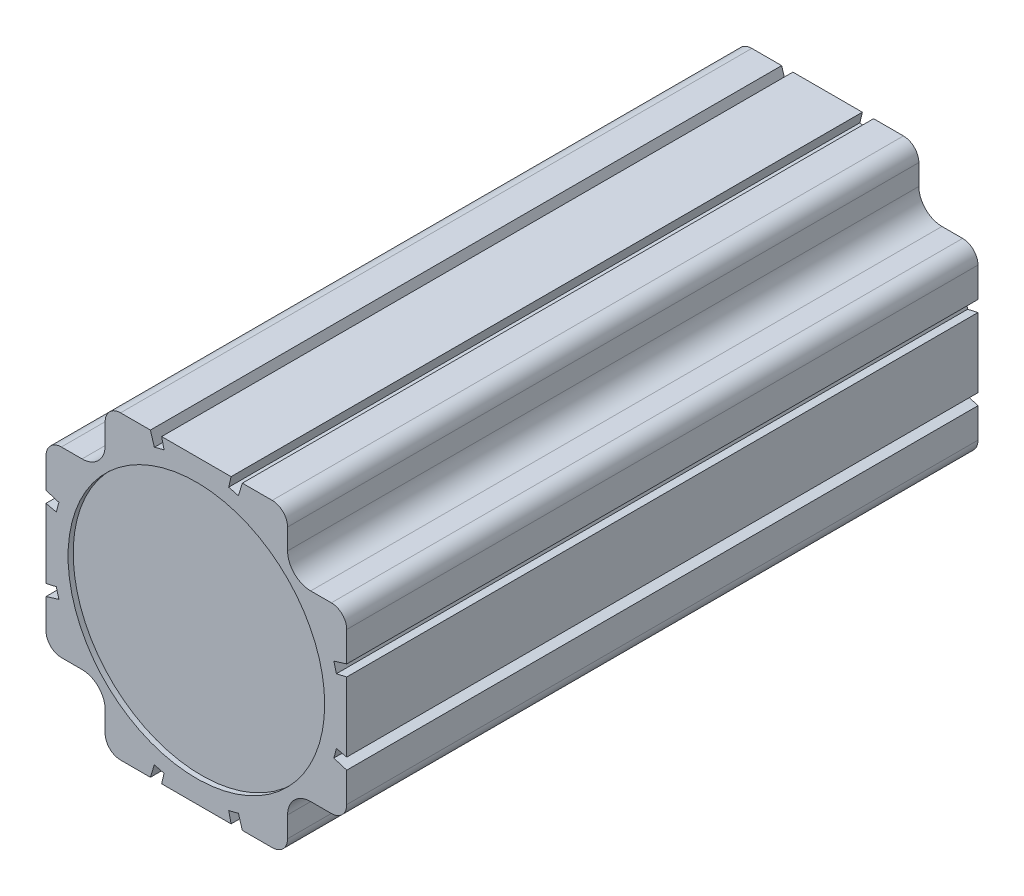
ISO-10303-21;
HEADER;
FILE_DESCRIPTION(('STEP AP214'),'2;1');
FILE_NAME('part.step','',(''),(''),'','','');
FILE_SCHEMA(('AUTOMOTIVE_DESIGN { 1 0 10303 214 1 1 1 1 }'));
ENDSEC;
DATA;
#1=APPLICATION_CONTEXT('core data for automotive mechanical design processes');
#2=APPLICATION_PROTOCOL_DEFINITION('international standard','automotive_design',2000,#1);
#3=PRODUCT_CONTEXT('',#1,'mechanical');
#4=PRODUCT('Part','Part','',(#3));
#5=PRODUCT_RELATED_PRODUCT_CATEGORY('part','',(#4));
#6=PRODUCT_DEFINITION_FORMATION('','',#4);
#7=PRODUCT_DEFINITION_CONTEXT('part definition',#1,'design');
#8=PRODUCT_DEFINITION('design','',#6,#7);
#9=PRODUCT_DEFINITION_SHAPE('','',#8);
#10=(LENGTH_UNIT() NAMED_UNIT(*) SI_UNIT(.MILLI.,.METRE.));
#11=(NAMED_UNIT(*) PLANE_ANGLE_UNIT() SI_UNIT($,.RADIAN.));
#12=(NAMED_UNIT(*) SI_UNIT($,.STERADIAN.) SOLID_ANGLE_UNIT());
#13=UNCERTAINTY_MEASURE_WITH_UNIT(LENGTH_MEASURE(1.E-05),#10,'distance_accuracy_value','');
#14=(GEOMETRIC_REPRESENTATION_CONTEXT(3) GLOBAL_UNCERTAINTY_ASSIGNED_CONTEXT((#13)) GLOBAL_UNIT_ASSIGNED_CONTEXT((#10,
#11,#12)) REPRESENTATION_CONTEXT('',''));
#15=CARTESIAN_POINT('',(0.,0.,0.));
#16=DIRECTION('',(0.,0.,1.));
#17=DIRECTION('',(1.,0.,0.));
#18=AXIS2_PLACEMENT_3D('',#15,#16,#17);
#19=CARTESIAN_POINT('',(-29.3,-29.3,123.));
#20=DIRECTION('',(0.,1.,0.));
#21=DIRECTION('',(0.,0.,1.));
#22=AXIS2_PLACEMENT_3D('',#19,#20,#21);
#23=PLANE('',#22);
#24=DIRECTION('',(1.,0.,0.));
#25=VECTOR('',#24,1.);
#26=CARTESIAN_POINT('',(-29.3,-29.3,123.));
#27=LINE('',#26,#25);
#28=CARTESIAN_POINT('',(8.95790896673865,-29.3,123.));
#29=VERTEX_POINT('',#28);
#30=CARTESIAN_POINT('',(14.7738636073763,-29.3,123.));
#31=VERTEX_POINT('',#30);
#32=EDGE_CURVE('E776',#29,#31,#27,.T.);
#33=ORIENTED_EDGE('',*,*,#32,.F.);
#34=DIRECTION('',(0.,0.,-1.));
#35=VECTOR('',#34,1.);
#36=CARTESIAN_POINT('',(8.95790896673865,-29.3,123.));
#37=LINE('',#36,#35);
#38=CARTESIAN_POINT('',(8.95790896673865,-29.3,0.));
#39=VERTEX_POINT('',#38);
#40=EDGE_CURVE('E403',#29,#39,#37,.T.);
#41=ORIENTED_EDGE('',*,*,#40,.T.);
#42=DIRECTION('',(1.,0.,0.));
#43=VECTOR('',#42,1.);
#44=CARTESIAN_POINT('',(-29.3,-29.3,0.));
#45=LINE('',#44,#43);
#46=CARTESIAN_POINT('',(14.7738636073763,-29.3,0.));
#47=VERTEX_POINT('',#46);
#48=EDGE_CURVE('E756',#39,#47,#45,.T.);
#49=ORIENTED_EDGE('',*,*,#48,.T.);
#50=DIRECTION('',(0.,0.,-1.));
#51=VECTOR('',#50,1.);
#52=CARTESIAN_POINT('',(14.7738636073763,-29.3,123.));
#53=LINE('',#52,#51);
#54=EDGE_CURVE('E716',#31,#47,#53,.T.);
#55=ORIENTED_EDGE('',*,*,#54,.F.);
#56=EDGE_LOOP('',(#33,#41,#49,#55));
#57=FACE_BOUND('',#56,.T.);
#58=ADVANCED_FACE('F17',(#57),#23,.F.);
#59=CARTESIAN_POINT('',(-29.3,29.3,123.));
#60=DIRECTION('',(1.,0.,0.));
#61=DIRECTION('',(0.,1.,0.));
#62=AXIS2_PLACEMENT_3D('',#59,#60,#61);
#63=PLANE('',#62);
#64=DIRECTION('',(0.,-1.,0.));
#65=VECTOR('',#64,1.);
#66=CARTESIAN_POINT('',(-29.3,29.3,123.));
#67=LINE('',#66,#65);
#68=CARTESIAN_POINT('',(-29.3,-8.95790896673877,123.));
#69=VERTEX_POINT('',#68);
#70=CARTESIAN_POINT('',(-29.3,-14.7738636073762,123.));
#71=VERTEX_POINT('',#70);
#72=EDGE_CURVE('E771',#69,#71,#67,.T.);
#73=ORIENTED_EDGE('',*,*,#72,.F.);
#74=DIRECTION('',(0.,0.,-1.));
#75=VECTOR('',#74,1.);
#76=CARTESIAN_POINT('',(-29.3,-8.95790896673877,123.));
#77=LINE('',#76,#75);
#78=CARTESIAN_POINT('',(-29.3,-8.95790896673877,0.));
#79=VERTEX_POINT('',#78);
#80=EDGE_CURVE('E424',#69,#79,#77,.T.);
#81=ORIENTED_EDGE('',*,*,#80,.T.);
#82=DIRECTION('',(0.,-1.,0.));
#83=VECTOR('',#82,1.);
#84=CARTESIAN_POINT('',(-29.3,29.3,0.));
#85=LINE('',#84,#83);
#86=CARTESIAN_POINT('',(-29.3,-14.7738636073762,0.));
#87=VERTEX_POINT('',#86);
#88=EDGE_CURVE('E695',#79,#87,#85,.T.);
#89=ORIENTED_EDGE('',*,*,#88,.T.);
#90=DIRECTION('',(0.,0.,-1.));
#91=VECTOR('',#90,1.);
#92=CARTESIAN_POINT('',(-29.3,-14.7738636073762,123.));
#93=LINE('',#92,#91);
#94=EDGE_CURVE('E701',#71,#87,#93,.T.);
#95=ORIENTED_EDGE('',*,*,#94,.F.);
#96=EDGE_LOOP('',(#73,#81,#89,#95));
#97=FACE_BOUND('',#96,.T.);
#98=ADVANCED_FACE('F819',(#97),#63,.F.);
#99=CARTESIAN_POINT('',(29.3,29.3,123.));
#100=DIRECTION('',(-1.,0.,0.));
#101=DIRECTION('',(0.,-1.,0.));
#102=AXIS2_PLACEMENT_3D('',#99,#100,#101);
#103=PLANE('',#102);
#104=DIRECTION('',(0.,1.,0.));
#105=VECTOR('',#104,1.);
#106=CARTESIAN_POINT('',(29.3,29.3,123.));
#107=LINE('',#106,#105);
#108=CARTESIAN_POINT('',(29.3,-6.76443799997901,123.));
#109=VERTEX_POINT('',#108);
#110=CARTESIAN_POINT('',(29.3,6.76443799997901,123.));
#111=VERTEX_POINT('',#110);
#112=EDGE_CURVE('E786',#109,#111,#107,.T.);
#113=ORIENTED_EDGE('',*,*,#112,.F.);
#114=DIRECTION('',(0.,0.,-1.));
#115=VECTOR('',#114,1.);
#116=CARTESIAN_POINT('',(29.3,-6.76443799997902,123.));
#117=LINE('',#116,#115);
#118=CARTESIAN_POINT('',(29.3,-6.76443799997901,0.));
#119=VERTEX_POINT('',#118);
#120=EDGE_CURVE('E448',#109,#119,#117,.T.);
#121=ORIENTED_EDGE('',*,*,#120,.T.);
#122=DIRECTION('',(0.,1.,0.));
#123=VECTOR('',#122,1.);
#124=CARTESIAN_POINT('',(29.3,29.3,0.));
#125=LINE('',#124,#123);
#126=CARTESIAN_POINT('',(29.3,6.76443799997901,0.));
#127=VERTEX_POINT('',#126);
#128=EDGE_CURVE('E767',#119,#127,#125,.T.);
#129=ORIENTED_EDGE('',*,*,#128,.T.);
#130=DIRECTION('',(0.,0.,1.));
#131=VECTOR('',#130,1.);
#132=CARTESIAN_POINT('',(29.3,6.76443799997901,123.));
#133=LINE('',#132,#131);
#134=EDGE_CURVE('E545',#127,#111,#133,.T.);
#135=ORIENTED_EDGE('',*,*,#134,.T.);
#136=EDGE_LOOP('',(#113,#121,#129,#135));
#137=FACE_BOUND('',#136,.T.);
#138=ADVANCED_FACE('F856',(#137),#103,.F.);
#139=CARTESIAN_POINT('',(-6.7644379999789,-29.3,0.));
#140=VERTEX_POINT('',#139);
#141=CARTESIAN_POINT('',(6.76443799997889,-29.3,0.));
#142=VERTEX_POINT('',#141);
#143=EDGE_CURVE('E762',#140,#142,#45,.T.);
#144=ORIENTED_EDGE('',*,*,#143,.T.);
#145=DIRECTION('',(0.,0.,1.));
#146=VECTOR('',#145,1.);
#147=CARTESIAN_POINT('',(6.76443799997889,-29.3,123.));
#148=LINE('',#147,#146);
#149=CARTESIAN_POINT('',(6.7644379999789,-29.3,123.));
#150=VERTEX_POINT('',#149);
#151=EDGE_CURVE('E32',#142,#150,#148,.T.);
#152=ORIENTED_EDGE('',*,*,#151,.T.);
#153=CARTESIAN_POINT('',(-6.7644379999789,-29.3,123.));
#154=VERTEX_POINT('',#153);
#155=EDGE_CURVE('E392',#154,#150,#27,.T.);
#156=ORIENTED_EDGE('',*,*,#155,.F.);
#157=DIRECTION('',(0.,0.,-1.));
#158=VECTOR('',#157,1.);
#159=CARTESIAN_POINT('',(-6.7644379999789,-29.3,123.));
#160=LINE('',#159,#158);
#161=EDGE_CURVE('E472',#154,#140,#160,.T.);
#162=ORIENTED_EDGE('',*,*,#161,.T.);
#163=EDGE_LOOP('',(#144,#152,#156,#162));
#164=FACE_BOUND('',#163,.T.);
#165=ADVANCED_FACE('F850',(#164),#23,.F.);
#166=CARTESIAN_POINT('',(-29.3,29.3,123.));
#167=DIRECTION('',(0.,-1.,0.));
#168=DIRECTION('',(0.,0.,-1.));
#169=AXIS2_PLACEMENT_3D('',#166,#167,#168);
#170=PLANE('',#169);
#171=DIRECTION('',(-1.,0.,0.));
#172=VECTOR('',#171,1.);
#173=CARTESIAN_POINT('',(-29.3,29.3,123.));
#174=LINE('',#173,#172);
#175=CARTESIAN_POINT('',(-8.95790896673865,29.3,123.));
#176=VERTEX_POINT('',#175);
#177=CARTESIAN_POINT('',(-14.7738636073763,29.3,123.));
#178=VERTEX_POINT('',#177);
#179=EDGE_CURVE('E785',#176,#178,#174,.T.);
#180=ORIENTED_EDGE('',*,*,#179,.F.);
#181=DIRECTION('',(0.,0.,-1.));
#182=VECTOR('',#181,1.);
#183=CARTESIAN_POINT('',(-8.95790896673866,29.3,123.));
#184=LINE('',#183,#182);
#185=CARTESIAN_POINT('',(-8.95790896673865,29.3,0.));
#186=VERTEX_POINT('',#185);
#187=EDGE_CURVE('E496',#176,#186,#184,.T.);
#188=ORIENTED_EDGE('',*,*,#187,.T.);
#189=DIRECTION('',(-1.,0.,0.));
#190=VECTOR('',#189,1.);
#191=CARTESIAN_POINT('',(-29.3,29.3,0.));
#192=LINE('',#191,#190);
#193=CARTESIAN_POINT('',(-14.7738636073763,29.3,0.));
#194=VERTEX_POINT('',#193);
#195=EDGE_CURVE('E766',#186,#194,#192,.T.);
#196=ORIENTED_EDGE('',*,*,#195,.T.);
#197=DIRECTION('',(0.,0.,-1.));
#198=VECTOR('',#197,1.);
#199=CARTESIAN_POINT('',(-14.7738636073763,29.3,123.));
#200=LINE('',#199,#198);
#201=EDGE_CURVE('E746',#178,#194,#200,.T.);
#202=ORIENTED_EDGE('',*,*,#201,.F.);
#203=EDGE_LOOP('',(#180,#188,#196,#202));
#204=FACE_BOUND('',#203,.T.);
#205=ADVANCED_FACE('F860',(#204),#170,.F.);
#206=CARTESIAN_POINT('',(-29.3,6.76443799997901,0.));
#207=VERTEX_POINT('',#206);
#208=CARTESIAN_POINT('',(-29.3,-6.764437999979,0.));
#209=VERTEX_POINT('',#208);
#210=EDGE_CURVE('E757',#207,#209,#85,.T.);
#211=ORIENTED_EDGE('',*,*,#210,.T.);
#212=DIRECTION('',(0.,0.,1.));
#213=VECTOR('',#212,1.);
#214=CARTESIAN_POINT('',(-29.3,-6.76443799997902,123.));
#215=LINE('',#214,#213);
#216=CARTESIAN_POINT('',(-29.3,-6.76443799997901,123.));
#217=VERTEX_POINT('',#216);
#218=EDGE_CURVE('E40',#209,#217,#215,.T.);
#219=ORIENTED_EDGE('',*,*,#218,.T.);
#220=CARTESIAN_POINT('',(-29.3,6.76443799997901,123.));
#221=VERTEX_POINT('',#220);
#222=EDGE_CURVE('E777',#221,#217,#67,.T.);
#223=ORIENTED_EDGE('',*,*,#222,.F.);
#224=DIRECTION('',(0.,0.,-1.));
#225=VECTOR('',#224,1.);
#226=CARTESIAN_POINT('',(-29.3,6.76443799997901,123.));
#227=LINE('',#226,#225);
#228=EDGE_CURVE('E520',#221,#207,#227,.T.);
#229=ORIENTED_EDGE('',*,*,#228,.T.);
#230=EDGE_LOOP('',(#211,#219,#223,#229));
#231=FACE_BOUND('',#230,.T.);
#232=ADVANCED_FACE('F830',(#231),#63,.F.);
#233=CARTESIAN_POINT('',(29.3,-14.7738636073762,0.));
#234=VERTEX_POINT('',#233);
#235=CARTESIAN_POINT('',(29.3,-8.95790896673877,0.));
#236=VERTEX_POINT('',#235);
#237=EDGE_CURVE('E763',#234,#236,#125,.T.);
#238=ORIENTED_EDGE('',*,*,#237,.T.);
#239=DIRECTION('',(0.,0.,1.));
#240=VECTOR('',#239,1.);
#241=CARTESIAN_POINT('',(29.3,-8.95790896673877,123.));
#242=LINE('',#241,#240);
#243=CARTESIAN_POINT('',(29.3,-8.95790896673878,123.));
#244=VERTEX_POINT('',#243);
#245=EDGE_CURVE('E444',#236,#244,#242,.T.);
#246=ORIENTED_EDGE('',*,*,#245,.T.);
#247=CARTESIAN_POINT('',(29.3,-14.7738636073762,123.));
#248=VERTEX_POINT('',#247);
#249=EDGE_CURVE('E782',#248,#244,#107,.T.);
#250=ORIENTED_EDGE('',*,*,#249,.F.);
#251=DIRECTION('',(0.,0.,-1.));
#252=VECTOR('',#251,1.);
#253=CARTESIAN_POINT('',(29.3,-14.7738636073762,123.));
#254=LINE('',#253,#252);
#255=EDGE_CURVE('E728',#248,#234,#254,.T.);
#256=ORIENTED_EDGE('',*,*,#255,.T.);
#257=EDGE_LOOP('',(#238,#246,#250,#256));
#258=FACE_BOUND('',#257,.T.);
#259=ADVANCED_FACE('F872',(#258),#103,.F.);
#260=CARTESIAN_POINT('',(6.7644379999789,29.3,0.));
#261=VERTEX_POINT('',#260);
#262=CARTESIAN_POINT('',(-6.7644379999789,29.3,0.));
#263=VERTEX_POINT('',#262);
#264=EDGE_CURVE('E772',#261,#263,#192,.T.);
#265=ORIENTED_EDGE('',*,*,#264,.T.);
#266=DIRECTION('',(0.,0.,1.));
#267=VECTOR('',#266,1.);
#268=CARTESIAN_POINT('',(-6.7644379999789,29.3,123.));
#269=LINE('',#268,#267);
#270=CARTESIAN_POINT('',(-6.7644379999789,29.3,123.));
#271=VERTEX_POINT('',#270);
#272=EDGE_CURVE('E492',#263,#271,#269,.T.);
#273=ORIENTED_EDGE('',*,*,#272,.T.);
#274=CARTESIAN_POINT('',(6.7644379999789,29.3,123.));
#275=VERTEX_POINT('',#274);
#276=EDGE_CURVE('E791',#275,#271,#174,.T.);
#277=ORIENTED_EDGE('',*,*,#276,.F.);
#278=DIRECTION('',(0.,0.,-1.));
#279=VECTOR('',#278,1.);
#280=CARTESIAN_POINT('',(6.7644379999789,29.3,123.));
#281=LINE('',#280,#279);
#282=EDGE_CURVE('E569',#275,#261,#281,.T.);
#283=ORIENTED_EDGE('',*,*,#282,.T.);
#284=EDGE_LOOP('',(#265,#273,#277,#283));
#285=FACE_BOUND('',#284,.T.);
#286=ADVANCED_FACE('F873',(#285),#170,.F.);
#287=CARTESIAN_POINT('',(-29.3,14.7738636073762,0.));
#288=VERTEX_POINT('',#287);
#289=CARTESIAN_POINT('',(-29.3,8.95790896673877,0.));
#290=VERTEX_POINT('',#289);
#291=EDGE_CURVE('E753',#288,#290,#85,.T.);
#292=ORIENTED_EDGE('',*,*,#291,.T.);
#293=DIRECTION('',(0.,0.,1.));
#294=VECTOR('',#293,1.);
#295=CARTESIAN_POINT('',(-29.3,8.95790896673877,123.));
#296=LINE('',#295,#294);
#297=CARTESIAN_POINT('',(-29.3,8.95790896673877,123.));
#298=VERTEX_POINT('',#297);
#299=EDGE_CURVE('E516',#290,#298,#296,.T.);
#300=ORIENTED_EDGE('',*,*,#299,.T.);
#301=CARTESIAN_POINT('',(-29.3,14.7738636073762,123.));
#302=VERTEX_POINT('',#301);
#303=EDGE_CURVE('E773',#302,#298,#67,.T.);
#304=ORIENTED_EDGE('',*,*,#303,.F.);
#305=DIRECTION('',(0.,0.,-1.));
#306=VECTOR('',#305,1.);
#307=CARTESIAN_POINT('',(-29.3,14.7738636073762,123.));
#308=LINE('',#307,#306);
#309=EDGE_CURVE('E698',#302,#288,#308,.T.);
#310=ORIENTED_EDGE('',*,*,#309,.T.);
#311=EDGE_LOOP('',(#292,#300,#304,#310));
#312=FACE_BOUND('',#311,.T.);
#313=ADVANCED_FACE('F19',(#312),#63,.F.);
#314=CARTESIAN_POINT('',(-14.7738636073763,-29.3,0.));
#315=VERTEX_POINT('',#314);
#316=CARTESIAN_POINT('',(-8.95790896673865,-29.3,0.));
#317=VERTEX_POINT('',#316);
#318=EDGE_CURVE('E758',#315,#317,#45,.T.);
#319=ORIENTED_EDGE('',*,*,#318,.T.);
#320=DIRECTION('',(0.,0.,1.));
#321=VECTOR('',#320,1.);
#322=CARTESIAN_POINT('',(-8.95790896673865,-29.3,123.));
#323=LINE('',#322,#321);
#324=CARTESIAN_POINT('',(-8.95790896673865,-29.3,123.));
#325=VERTEX_POINT('',#324);
#326=EDGE_CURVE('E468',#317,#325,#323,.T.);
#327=ORIENTED_EDGE('',*,*,#326,.T.);
#328=CARTESIAN_POINT('',(-14.7738636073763,-29.3,123.));
#329=VERTEX_POINT('',#328);
#330=EDGE_CURVE('E778',#329,#325,#27,.T.);
#331=ORIENTED_EDGE('',*,*,#330,.F.);
#332=DIRECTION('',(0.,0.,-1.));
#333=VECTOR('',#332,1.);
#334=CARTESIAN_POINT('',(-14.7738636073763,-29.3,123.));
#335=LINE('',#334,#333);
#336=EDGE_CURVE('E713',#329,#315,#335,.T.);
#337=ORIENTED_EDGE('',*,*,#336,.T.);
#338=EDGE_LOOP('',(#319,#327,#331,#337));
#339=FACE_BOUND('',#338,.T.);
#340=ADVANCED_FACE('F851',(#339),#23,.F.);
#341=CARTESIAN_POINT('',(29.3,8.95790896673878,123.));
#342=VERTEX_POINT('',#341);
#343=CARTESIAN_POINT('',(29.3,14.7738636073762,123.));
#344=VERTEX_POINT('',#343);
#345=EDGE_CURVE('E781',#342,#344,#107,.T.);
#346=ORIENTED_EDGE('',*,*,#345,.F.);
#347=DIRECTION('',(0.,0.,-1.));
#348=VECTOR('',#347,1.);
#349=CARTESIAN_POINT('',(29.3,8.95790896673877,123.));
#350=LINE('',#349,#348);
#351=CARTESIAN_POINT('',(29.3,8.95790896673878,0.));
#352=VERTEX_POINT('',#351);
#353=EDGE_CURVE('E540',#342,#352,#350,.T.);
#354=ORIENTED_EDGE('',*,*,#353,.T.);
#355=CARTESIAN_POINT('',(29.3,14.7738636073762,0.));
#356=VERTEX_POINT('',#355);
#357=EDGE_CURVE('E761',#352,#356,#125,.T.);
#358=ORIENTED_EDGE('',*,*,#357,.T.);
#359=DIRECTION('',(0.,0.,-1.));
#360=VECTOR('',#359,1.);
#361=CARTESIAN_POINT('',(29.3,14.7738636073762,123.));
#362=LINE('',#361,#360);
#363=EDGE_CURVE('E731',#344,#356,#362,.T.);
#364=ORIENTED_EDGE('',*,*,#363,.F.);
#365=EDGE_LOOP('',(#346,#354,#358,#364));
#366=FACE_BOUND('',#365,.T.);
#367=ADVANCED_FACE('F863',(#366),#103,.F.);
#368=CARTESIAN_POINT('',(14.7738636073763,29.3,0.));
#369=VERTEX_POINT('',#368);
#370=CARTESIAN_POINT('',(8.95790896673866,29.3,0.));
#371=VERTEX_POINT('',#370);
#372=EDGE_CURVE('E768',#369,#371,#192,.T.);
#373=ORIENTED_EDGE('',*,*,#372,.T.);
#374=DIRECTION('',(0.,0.,1.));
#375=VECTOR('',#374,1.);
#376=CARTESIAN_POINT('',(8.95790896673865,29.3,123.));
#377=LINE('',#376,#375);
#378=CARTESIAN_POINT('',(8.95790896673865,29.3,123.));
#379=VERTEX_POINT('',#378);
#380=EDGE_CURVE('E565',#371,#379,#377,.T.);
#381=ORIENTED_EDGE('',*,*,#380,.T.);
#382=CARTESIAN_POINT('',(14.7738636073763,29.3,123.));
#383=VERTEX_POINT('',#382);
#384=EDGE_CURVE('E787',#383,#379,#174,.T.);
#385=ORIENTED_EDGE('',*,*,#384,.F.);
#386=DIRECTION('',(0.,0.,-1.));
#387=VECTOR('',#386,1.);
#388=CARTESIAN_POINT('',(14.7738636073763,29.3,123.));
#389=LINE('',#388,#387);
#390=EDGE_CURVE('E743',#383,#369,#389,.T.);
#391=ORIENTED_EDGE('',*,*,#390,.T.);
#392=EDGE_LOOP('',(#373,#381,#385,#391));
#393=FACE_BOUND('',#392,.T.);
#394=ADVANCED_FACE('F870',(#393),#170,.F.);
#395=CARTESIAN_POINT('',(-29.3,-29.3,123.));
#396=DIRECTION('',(0.,0.,1.));
#397=DIRECTION('',(1.,0.,0.));
#398=AXIS2_PLACEMENT_3D('',#395,#396,#397);
#399=PLANE('',#398);
#400=CARTESIAN_POINT('',(0.,0.,123.));
#401=DIRECTION('',(0.,0.,1.));
#402=DIRECTION('',(1.,0.,0.));
#403=AXIS2_PLACEMENT_3D('',#400,#401,#402);
#404=CIRCLE('',#403,25.);
#405=CARTESIAN_POINT('',(25.,0.,123.));
#406=VERTEX_POINT('',#405);
#407=EDGE_CURVE('E1519',#406,#406,#404,.T.);
#408=ORIENTED_EDGE('',*,*,#407,.F.);
#409=EDGE_LOOP('',(#408));
#410=FACE_BOUND('',#409,.T.);
#411=DIRECTION('',(-0.292371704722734,0.956304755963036,0.));
#412=VECTOR('',#411,1.);
#413=CARTESIAN_POINT('',(8.18640773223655,-26.776533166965,123.));
#414=LINE('',#413,#412);
#415=CARTESIAN_POINT('',(8.18640773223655,-26.776533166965,123.));
#416=VERTEX_POINT('',#415);
#417=EDGE_CURVE('E393',#29,#416,#414,.T.);
#418=ORIENTED_EDGE('',*,*,#417,.F.);
#419=ORIENTED_EDGE('',*,*,#32,.T.);
#420=CARTESIAN_POINT('',(14.7738636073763,-26.3,123.));
#421=DIRECTION('',(0.,0.,-1.));
#422=DIRECTION('',(-1.,0.,0.));
#423=AXIS2_PLACEMENT_3D('',#420,#421,#422);
#424=CIRCLE('',#423,3.);
#425=CARTESIAN_POINT('',(17.7738636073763,-26.3,123.));
#426=VERTEX_POINT('',#425);
#427=EDGE_CURVE('E668',#426,#31,#424,.T.);
#428=ORIENTED_EDGE('',*,*,#427,.F.);
#429=DIRECTION('',(0.,-1.,0.));
#430=VECTOR('',#429,1.);
#431=CARTESIAN_POINT('',(17.7738636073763,-22.2738636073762,123.));
#432=LINE('',#431,#430);
#433=CARTESIAN_POINT('',(17.7738636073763,-22.2738636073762,123.));
#434=VERTEX_POINT('',#433);
#435=EDGE_CURVE('E665',#434,#426,#432,.T.);
#436=ORIENTED_EDGE('',*,*,#435,.F.);
#437=CARTESIAN_POINT('',(22.2738636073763,-22.2738636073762,123.));
#438=DIRECTION('',(0.,0.,1.));
#439=DIRECTION('',(-1.,0.,0.));
#440=AXIS2_PLACEMENT_3D('',#437,#438,#439);
#441=CIRCLE('',#440,4.5);
#442=CARTESIAN_POINT('',(22.2738636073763,-17.7738636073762,123.));
#443=VERTEX_POINT('',#442);
#444=EDGE_CURVE('E662',#443,#434,#441,.T.);
#445=ORIENTED_EDGE('',*,*,#444,.F.);
#446=DIRECTION('',(-1.,0.,0.));
#447=VECTOR('',#446,1.);
#448=CARTESIAN_POINT('',(22.2738636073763,-17.7738636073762,123.));
#449=LINE('',#448,#447);
#450=CARTESIAN_POINT('',(26.3,-17.7738636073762,123.));
#451=VERTEX_POINT('',#450);
#452=EDGE_CURVE('E659',#451,#443,#449,.T.);
#453=ORIENTED_EDGE('',*,*,#452,.F.);
#454=CARTESIAN_POINT('',(26.3,-14.7738636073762,123.));
#455=DIRECTION('',(0.,0.,-1.));
#456=DIRECTION('',(-1.,0.,0.));
#457=AXIS2_PLACEMENT_3D('',#454,#455,#456);
#458=CIRCLE('',#457,3.);
#459=EDGE_CURVE('E656',#248,#451,#458,.T.);
#460=ORIENTED_EDGE('',*,*,#459,.F.);
#461=ORIENTED_EDGE('',*,*,#249,.T.);
#462=DIRECTION('',(0.956304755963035,-0.292371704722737,0.));
#463=VECTOR('',#462,1.);
#464=CARTESIAN_POINT('',(26.776533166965,-8.18640773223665,123.));
#465=LINE('',#464,#463);
#466=CARTESIAN_POINT('',(26.776533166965,-8.18640773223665,123.));
#467=VERTEX_POINT('',#466);
#468=EDGE_CURVE('E430',#467,#244,#465,.T.);
#469=ORIENTED_EDGE('',*,*,#468,.F.);
#470=CARTESIAN_POINT('',(0.,0.,123.));
#471=DIRECTION('',(0.,0.,-1.));
#472=DIRECTION('',(-1.,0.,0.));
#473=AXIS2_PLACEMENT_3D('',#470,#471,#472);
#474=CIRCLE('',#473,28.);
#475=CARTESIAN_POINT('',(27.2823618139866,-6.29862952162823,123.));
#476=VERTEX_POINT('',#475);
#477=EDGE_CURVE('E427',#476,#467,#474,.T.);
#478=ORIENTED_EDGE('',*,*,#477,.F.);
#479=DIRECTION('',(-0.974370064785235,0.224951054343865,0.));
#480=VECTOR('',#479,1.);
#481=CARTESIAN_POINT('',(27.2823618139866,-6.29862952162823,123.));
#482=LINE('',#481,#480);
#483=EDGE_CURVE('E432',#109,#476,#482,.T.);
#484=ORIENTED_EDGE('',*,*,#483,.F.);
#485=ORIENTED_EDGE('',*,*,#112,.T.);
#486=DIRECTION('',(0.974370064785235,0.224951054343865,0.));
#487=VECTOR('',#486,1.);
#488=CARTESIAN_POINT('',(27.2823618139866,6.29862952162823,123.));
#489=LINE('',#488,#487);
#490=CARTESIAN_POINT('',(27.2823618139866,6.29862952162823,123.));
#491=VERTEX_POINT('',#490);
#492=EDGE_CURVE('E528',#491,#111,#489,.T.);
#493=ORIENTED_EDGE('',*,*,#492,.F.);
#494=CARTESIAN_POINT('',(0.,0.,123.));
#495=DIRECTION('',(0.,0.,-1.));
#496=DIRECTION('',(1.,0.,0.));
#497=AXIS2_PLACEMENT_3D('',#494,#495,#496);
#498=CIRCLE('',#497,28.);
#499=CARTESIAN_POINT('',(26.776533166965,8.18640773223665,123.));
#500=VERTEX_POINT('',#499);
#501=EDGE_CURVE('E525',#500,#491,#498,.T.);
#502=ORIENTED_EDGE('',*,*,#501,.F.);
#503=DIRECTION('',(-0.956304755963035,-0.292371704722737,0.));
#504=VECTOR('',#503,1.);
#505=CARTESIAN_POINT('',(26.776533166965,8.18640773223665,123.));
#506=LINE('',#505,#504);
#507=EDGE_CURVE('E523',#342,#500,#506,.T.);
#508=ORIENTED_EDGE('',*,*,#507,.F.);
#509=ORIENTED_EDGE('',*,*,#345,.T.);
#510=CARTESIAN_POINT('',(26.3,14.7738636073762,123.));
#511=DIRECTION('',(0.,0.,-1.));
#512=DIRECTION('',(1.,0.,0.));
#513=AXIS2_PLACEMENT_3D('',#510,#511,#512);
#514=CIRCLE('',#513,3.);
#515=CARTESIAN_POINT('',(26.3,17.7738636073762,123.));
#516=VERTEX_POINT('',#515);
#517=EDGE_CURVE('E653',#516,#344,#514,.T.);
#518=ORIENTED_EDGE('',*,*,#517,.F.);
#519=DIRECTION('',(1.,0.,0.));
#520=VECTOR('',#519,1.);
#521=CARTESIAN_POINT('',(22.2738636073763,17.7738636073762,123.));
#522=LINE('',#521,#520);
#523=CARTESIAN_POINT('',(22.2738636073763,17.7738636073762,123.));
#524=VERTEX_POINT('',#523);
#525=EDGE_CURVE('E650',#524,#516,#522,.T.);
#526=ORIENTED_EDGE('',*,*,#525,.F.);
#527=CARTESIAN_POINT('',(22.2738636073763,22.2738636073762,123.));
#528=DIRECTION('',(0.,0.,1.));
#529=DIRECTION('',(1.,0.,0.));
#530=AXIS2_PLACEMENT_3D('',#527,#528,#529);
#531=CIRCLE('',#530,4.5);
#532=CARTESIAN_POINT('',(17.7738636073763,22.2738636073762,123.));
#533=VERTEX_POINT('',#532);
#534=EDGE_CURVE('E647',#533,#524,#531,.T.);
#535=ORIENTED_EDGE('',*,*,#534,.F.);
#536=DIRECTION('',(0.,-1.,0.));
#537=VECTOR('',#536,1.);
#538=CARTESIAN_POINT('',(17.7738636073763,22.2738636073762,123.));
#539=LINE('',#538,#537);
#540=CARTESIAN_POINT('',(17.7738636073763,26.3,123.));
#541=VERTEX_POINT('',#540);
#542=EDGE_CURVE('E644',#541,#533,#539,.T.);
#543=ORIENTED_EDGE('',*,*,#542,.F.);
#544=CARTESIAN_POINT('',(14.7738636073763,26.3,123.));
#545=DIRECTION('',(0.,0.,-1.));
#546=DIRECTION('',(1.,0.,0.));
#547=AXIS2_PLACEMENT_3D('',#544,#545,#546);
#548=CIRCLE('',#547,3.);
#549=EDGE_CURVE('E641',#383,#541,#548,.T.);
#550=ORIENTED_EDGE('',*,*,#549,.F.);
#551=ORIENTED_EDGE('',*,*,#384,.T.);
#552=DIRECTION('',(0.292371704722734,0.956304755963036,0.));
#553=VECTOR('',#552,1.);
#554=CARTESIAN_POINT('',(8.18640773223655,26.776533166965,123.));
#555=LINE('',#554,#553);
#556=CARTESIAN_POINT('',(8.18640773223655,26.776533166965,123.));
#557=VERTEX_POINT('',#556);
#558=EDGE_CURVE('E551',#557,#379,#555,.T.);
#559=ORIENTED_EDGE('',*,*,#558,.F.);
#560=CARTESIAN_POINT('',(0.,0.,123.));
#561=DIRECTION('',(0.,0.,-1.));
#562=DIRECTION('',(-1.,0.,0.));
#563=AXIS2_PLACEMENT_3D('',#560,#561,#562);
#564=CIRCLE('',#563,28.);
#565=CARTESIAN_POINT('',(6.29862952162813,27.2823618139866,123.));
#566=VERTEX_POINT('',#565);
#567=EDGE_CURVE('E548',#566,#557,#564,.T.);
#568=ORIENTED_EDGE('',*,*,#567,.F.);
#569=DIRECTION('',(-0.224951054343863,-0.974370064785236,0.));
#570=VECTOR('',#569,1.);
#571=CARTESIAN_POINT('',(6.29862952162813,27.2823618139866,123.));
#572=LINE('',#571,#570);
#573=EDGE_CURVE('E553',#275,#566,#572,.T.);
#574=ORIENTED_EDGE('',*,*,#573,.F.);
#575=ORIENTED_EDGE('',*,*,#276,.T.);
#576=DIRECTION('',(-0.224951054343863,0.974370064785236,0.));
#577=VECTOR('',#576,1.);
#578=CARTESIAN_POINT('',(-6.29862952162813,27.2823618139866,123.));
#579=LINE('',#578,#577);
#580=CARTESIAN_POINT('',(-6.29862952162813,27.2823618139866,123.));
#581=VERTEX_POINT('',#580);
#582=EDGE_CURVE('E478',#581,#271,#579,.T.);
#583=ORIENTED_EDGE('',*,*,#582,.F.);
#584=CARTESIAN_POINT('',(0.,0.,123.));
#585=DIRECTION('',(0.,0.,-1.));
#586=DIRECTION('',(1.,0.,0.));
#587=AXIS2_PLACEMENT_3D('',#584,#585,#586);
#588=CIRCLE('',#587,28.);
#589=CARTESIAN_POINT('',(-8.18640773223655,26.776533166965,123.));
#590=VERTEX_POINT('',#589);
#591=EDGE_CURVE('E475',#590,#581,#588,.T.);
#592=ORIENTED_EDGE('',*,*,#591,.F.);
#593=DIRECTION('',(0.292371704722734,-0.956304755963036,0.));
#594=VECTOR('',#593,1.);
#595=CARTESIAN_POINT('',(-8.18640773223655,26.776533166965,123.));
#596=LINE('',#595,#594);
#597=EDGE_CURVE('E480',#176,#590,#596,.T.);
#598=ORIENTED_EDGE('',*,*,#597,.F.);
#599=ORIENTED_EDGE('',*,*,#179,.T.);
#600=CARTESIAN_POINT('',(-14.7738636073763,26.3,123.));
#601=DIRECTION('',(0.,0.,-1.));
#602=DIRECTION('',(-1.,0.,0.));
#603=AXIS2_PLACEMENT_3D('',#600,#601,#602);
#604=CIRCLE('',#603,3.);
#605=CARTESIAN_POINT('',(-17.7738636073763,26.3,123.));
#606=VERTEX_POINT('',#605);
#607=EDGE_CURVE('E638',#606,#178,#604,.T.);
#608=ORIENTED_EDGE('',*,*,#607,.F.);
#609=DIRECTION('',(0.,1.,0.));
#610=VECTOR('',#609,1.);
#611=CARTESIAN_POINT('',(-17.7738636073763,22.2738636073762,123.));
#612=LINE('',#611,#610);
#613=CARTESIAN_POINT('',(-17.7738636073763,22.2738636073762,123.));
#614=VERTEX_POINT('',#613);
#615=EDGE_CURVE('E635',#614,#606,#612,.T.);
#616=ORIENTED_EDGE('',*,*,#615,.F.);
#617=CARTESIAN_POINT('',(-22.2738636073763,22.2738636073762,123.));
#618=DIRECTION('',(0.,0.,1.));
#619=DIRECTION('',(-1.,0.,0.));
#620=AXIS2_PLACEMENT_3D('',#617,#618,#619);
#621=CIRCLE('',#620,4.5);
#622=CARTESIAN_POINT('',(-22.2738636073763,17.7738636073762,123.));
#623=VERTEX_POINT('',#622);
#624=EDGE_CURVE('E632',#623,#614,#621,.T.);
#625=ORIENTED_EDGE('',*,*,#624,.F.);
#626=DIRECTION('',(1.,0.,0.));
#627=VECTOR('',#626,1.);
#628=CARTESIAN_POINT('',(-22.2738636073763,17.7738636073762,123.));
#629=LINE('',#628,#627);
#630=CARTESIAN_POINT('',(-26.3,17.7738636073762,123.));
#631=VERTEX_POINT('',#630);
#632=EDGE_CURVE('E689',#631,#623,#629,.T.);
#633=ORIENTED_EDGE('',*,*,#632,.F.);
#634=CARTESIAN_POINT('',(-26.3,14.7738636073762,123.));
#635=DIRECTION('',(0.,0.,-1.));
#636=DIRECTION('',(-1.,0.,0.));
#637=AXIS2_PLACEMENT_3D('',#634,#635,#636);
#638=CIRCLE('',#637,3.);
#639=EDGE_CURVE('E686',#302,#631,#638,.T.);
#640=ORIENTED_EDGE('',*,*,#639,.F.);
#641=ORIENTED_EDGE('',*,*,#303,.T.);
#642=DIRECTION('',(-0.956304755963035,0.292371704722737,0.));
#643=VECTOR('',#642,1.);
#644=CARTESIAN_POINT('',(-26.776533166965,8.18640773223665,123.));
#645=LINE('',#644,#643);
#646=CARTESIAN_POINT('',(-26.776533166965,8.18640773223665,123.));
#647=VERTEX_POINT('',#646);
#648=EDGE_CURVE('E502',#647,#298,#645,.T.);
#649=ORIENTED_EDGE('',*,*,#648,.F.);
#650=CARTESIAN_POINT('',(0.,0.,123.));
#651=DIRECTION('',(0.,0.,-1.));
#652=DIRECTION('',(-1.,0.,0.));
#653=AXIS2_PLACEMENT_3D('',#650,#651,#652);
#654=CIRCLE('',#653,28.);
#655=CARTESIAN_POINT('',(-27.2823618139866,6.29862952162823,123.));
#656=VERTEX_POINT('',#655);
#657=EDGE_CURVE('E499',#656,#647,#654,.T.);
#658=ORIENTED_EDGE('',*,*,#657,.F.);
#659=DIRECTION('',(0.974370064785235,-0.224951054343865,0.));
#660=VECTOR('',#659,1.);
#661=CARTESIAN_POINT('',(-27.2823618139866,6.29862952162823,123.));
#662=LINE('',#661,#660);
#663=EDGE_CURVE('E504',#221,#656,#662,.T.);
#664=ORIENTED_EDGE('',*,*,#663,.F.);
#665=ORIENTED_EDGE('',*,*,#222,.T.);
#666=DIRECTION('',(-0.974370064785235,-0.224951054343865,0.));
#667=VECTOR('',#666,1.);
#668=CARTESIAN_POINT('',(-27.2823618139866,-6.29862952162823,123.));
#669=LINE('',#668,#667);
#670=CARTESIAN_POINT('',(-27.2823618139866,-6.29862952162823,123.));
#671=VERTEX_POINT('',#670);
#672=EDGE_CURVE('E409',#671,#217,#669,.T.);
#673=ORIENTED_EDGE('',*,*,#672,.F.);
#674=CARTESIAN_POINT('',(0.,0.,123.));
#675=DIRECTION('',(0.,0.,-1.));
#676=DIRECTION('',(1.,0.,0.));
#677=AXIS2_PLACEMENT_3D('',#674,#675,#676);
#678=CIRCLE('',#677,28.);
#679=CARTESIAN_POINT('',(-26.776533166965,-8.18640773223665,123.));
#680=VERTEX_POINT('',#679);
#681=EDGE_CURVE('E406',#680,#671,#678,.T.);
#682=ORIENTED_EDGE('',*,*,#681,.F.);
#683=DIRECTION('',(0.956304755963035,0.292371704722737,0.));
#684=VECTOR('',#683,1.);
#685=CARTESIAN_POINT('',(-26.776533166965,-8.18640773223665,123.));
#686=LINE('',#685,#684);
#687=EDGE_CURVE('E411',#69,#680,#686,.T.);
#688=ORIENTED_EDGE('',*,*,#687,.F.);
#689=ORIENTED_EDGE('',*,*,#72,.T.);
#690=CARTESIAN_POINT('',(-26.3,-14.7738636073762,123.));
#691=DIRECTION('',(0.,0.,-1.));
#692=DIRECTION('',(1.,0.,0.));
#693=AXIS2_PLACEMENT_3D('',#690,#691,#692);
#694=CIRCLE('',#693,3.);
#695=CARTESIAN_POINT('',(-26.3,-17.7738636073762,123.));
#696=VERTEX_POINT('',#695);
#697=EDGE_CURVE('E683',#696,#71,#694,.T.);
#698=ORIENTED_EDGE('',*,*,#697,.F.);
#699=DIRECTION('',(-1.,0.,0.));
#700=VECTOR('',#699,1.);
#701=CARTESIAN_POINT('',(-22.2738636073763,-17.7738636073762,123.));
#702=LINE('',#701,#700);
#703=CARTESIAN_POINT('',(-22.2738636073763,-17.7738636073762,123.));
#704=VERTEX_POINT('',#703);
#705=EDGE_CURVE('E680',#704,#696,#702,.T.);
#706=ORIENTED_EDGE('',*,*,#705,.F.);
#707=CARTESIAN_POINT('',(-22.2738636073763,-22.2738636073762,123.));
#708=DIRECTION('',(0.,0.,1.));
#709=DIRECTION('',(1.,0.,0.));
#710=AXIS2_PLACEMENT_3D('',#707,#708,#709);
#711=CIRCLE('',#710,4.5);
#712=CARTESIAN_POINT('',(-17.7738636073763,-22.2738636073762,123.));
#713=VERTEX_POINT('',#712);
#714=EDGE_CURVE('E677',#713,#704,#711,.T.);
#715=ORIENTED_EDGE('',*,*,#714,.F.);
#716=DIRECTION('',(0.,1.,0.));
#717=VECTOR('',#716,1.);
#718=CARTESIAN_POINT('',(-17.7738636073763,-22.2738636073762,123.));
#719=LINE('',#718,#717);
#720=CARTESIAN_POINT('',(-17.7738636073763,-26.3,123.));
#721=VERTEX_POINT('',#720);
#722=EDGE_CURVE('E674',#721,#713,#719,.T.);
#723=ORIENTED_EDGE('',*,*,#722,.F.);
#724=CARTESIAN_POINT('',(-14.7738636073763,-26.3,123.));
#725=DIRECTION('',(0.,0.,-1.));
#726=DIRECTION('',(1.,0.,0.));
#727=AXIS2_PLACEMENT_3D('',#724,#725,#726);
#728=CIRCLE('',#727,3.);
#729=EDGE_CURVE('E671',#329,#721,#728,.T.);
#730=ORIENTED_EDGE('',*,*,#729,.F.);
#731=ORIENTED_EDGE('',*,*,#330,.T.);
#732=DIRECTION('',(-0.292371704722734,-0.956304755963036,0.));
#733=VECTOR('',#732,1.);
#734=CARTESIAN_POINT('',(-8.18640773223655,-26.776533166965,123.));
#735=LINE('',#734,#733);
#736=CARTESIAN_POINT('',(-8.18640773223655,-26.776533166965,123.));
#737=VERTEX_POINT('',#736);
#738=EDGE_CURVE('E454',#737,#325,#735,.T.);
#739=ORIENTED_EDGE('',*,*,#738,.F.);
#740=CARTESIAN_POINT('',(0.,0.,123.));
#741=DIRECTION('',(0.,0.,-1.));
#742=DIRECTION('',(-1.,0.,0.));
#743=AXIS2_PLACEMENT_3D('',#740,#741,#742);
#744=CIRCLE('',#743,28.);
#745=CARTESIAN_POINT('',(-6.29862952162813,-27.2823618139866,123.));
#746=VERTEX_POINT('',#745);
#747=EDGE_CURVE('E451',#746,#737,#744,.T.);
#748=ORIENTED_EDGE('',*,*,#747,.F.);
#749=DIRECTION('',(0.224951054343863,0.974370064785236,0.));
#750=VECTOR('',#749,1.);
#751=CARTESIAN_POINT('',(-6.29862952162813,-27.2823618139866,123.));
#752=LINE('',#751,#750);
#753=EDGE_CURVE('E456',#154,#746,#752,.T.);
#754=ORIENTED_EDGE('',*,*,#753,.F.);
#755=ORIENTED_EDGE('',*,*,#155,.T.);
#756=DIRECTION('',(0.224951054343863,-0.974370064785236,0.));
#757=VECTOR('',#756,1.);
#758=CARTESIAN_POINT('',(6.29862952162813,-27.2823618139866,123.));
#759=LINE('',#758,#757);
#760=CARTESIAN_POINT('',(6.29862952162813,-27.2823618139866,123.));
#761=VERTEX_POINT('',#760);
#762=EDGE_CURVE('E373',#761,#150,#759,.T.);
#763=ORIENTED_EDGE('',*,*,#762,.F.);
#764=CARTESIAN_POINT('',(0.,0.,123.));
#765=DIRECTION('',(0.,0.,-1.));
#766=DIRECTION('',(1.,0.,0.));
#767=AXIS2_PLACEMENT_3D('',#764,#765,#766);
#768=CIRCLE('',#767,28.);
#769=EDGE_CURVE('E382',#416,#761,#768,.T.);
#770=ORIENTED_EDGE('',*,*,#769,.F.);
#771=EDGE_LOOP('',(#418,#419,#428,#436,#445,#453,#460,#461,#469,#478,#484,#485,#493,#502,#508,
#509,#518,#526,#535,#543,#550,#551,#559,#568,#574,#575,#583,#592,#598,#599,#608,#616,#625,#633,
#640,#641,#649,#658,#664,#665,#673,#682,#688,#689,#698,#706,#715,#723,#730,#731,#739,#748,#754,
#755,#763,#770));
#772=FACE_BOUND('',#771,.T.);
#773=ADVANCED_FACE('F389',(#410,#772),#399,.T.);
#774=CARTESIAN_POINT('',(-29.3,-29.3,0.));
#775=DIRECTION('',(0.,0.,1.));
#776=DIRECTION('',(1.,0.,0.));
#777=AXIS2_PLACEMENT_3D('',#774,#775,#776);
#778=PLANE('',#777);
#779=CARTESIAN_POINT('',(0.,0.,0.));
#780=DIRECTION('',(0.,0.,-1.));
#781=DIRECTION('',(-1.,0.,0.));
#782=AXIS2_PLACEMENT_3D('',#779,#780,#781);
#783=CIRCLE('',#782,25.);
#784=CARTESIAN_POINT('',(-25.,0.,0.));
#785=VERTEX_POINT('',#784);
#786=EDGE_CURVE('E1520',#785,#785,#783,.T.);
#787=ORIENTED_EDGE('',*,*,#786,.F.);
#788=EDGE_LOOP('',(#787));
#789=FACE_BOUND('',#788,.T.);
#790=ORIENTED_EDGE('',*,*,#48,.F.);
#791=DIRECTION('',(-0.292371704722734,0.956304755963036,0.));
#792=VECTOR('',#791,1.);
#793=CARTESIAN_POINT('',(5.68757647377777,-18.603224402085,0.));
#794=LINE('',#793,#792);
#795=CARTESIAN_POINT('',(8.18640773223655,-26.776533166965,0.));
#796=VERTEX_POINT('',#795);
#797=EDGE_CURVE('E11',#39,#796,#794,.T.);
#798=ORIENTED_EDGE('',*,*,#797,.T.);
#799=CARTESIAN_POINT('',(0.,0.,0.));
#800=DIRECTION('',(0.,0.,-1.));
#801=DIRECTION('',(1.,0.,0.));
#802=AXIS2_PLACEMENT_3D('',#799,#800,#801);
#803=CIRCLE('',#802,28.);
#804=CARTESIAN_POINT('',(6.29862952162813,-27.2823618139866,0.));
#805=VERTEX_POINT('',#804);
#806=EDGE_CURVE('E395',#796,#805,#803,.T.);
#807=ORIENTED_EDGE('',*,*,#806,.T.);
#808=DIRECTION('',(0.224951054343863,-0.974370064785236,0.));
#809=VECTOR('',#808,1.);
#810=CARTESIAN_POINT('',(6.29862952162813,-27.2823618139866,0.));
#811=LINE('',#810,#809);
#812=EDGE_CURVE('E374',#805,#142,#811,.T.);
#813=ORIENTED_EDGE('',*,*,#812,.T.);
#814=ORIENTED_EDGE('',*,*,#143,.F.);
#815=DIRECTION('',(0.224951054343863,0.974370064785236,0.));
#816=VECTOR('',#815,1.);
#817=CARTESIAN_POINT('',(-7.90480452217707,-34.2394700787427,0.));
#818=LINE('',#817,#816);
#819=CARTESIAN_POINT('',(-6.29862952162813,-27.2823618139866,0.));
#820=VERTEX_POINT('',#819);
#821=EDGE_CURVE('E803',#140,#820,#818,.T.);
#822=ORIENTED_EDGE('',*,*,#821,.T.);
#823=CARTESIAN_POINT('',(0.,0.,0.));
#824=DIRECTION('',(0.,0.,-1.));
#825=DIRECTION('',(-1.,0.,0.));
#826=AXIS2_PLACEMENT_3D('',#823,#824,#825);
#827=CIRCLE('',#826,28.);
#828=CARTESIAN_POINT('',(-8.18640773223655,-26.776533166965,0.));
#829=VERTEX_POINT('',#828);
#830=EDGE_CURVE('E458',#820,#829,#827,.T.);
#831=ORIENTED_EDGE('',*,*,#830,.T.);
#832=DIRECTION('',(-0.292371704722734,-0.956304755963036,0.));
#833=VECTOR('',#832,1.);
#834=CARTESIAN_POINT('',(-8.18640773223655,-26.776533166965,0.));
#835=LINE('',#834,#833);
#836=EDGE_CURVE('E461',#829,#317,#835,.T.);
#837=ORIENTED_EDGE('',*,*,#836,.T.);
#838=ORIENTED_EDGE('',*,*,#318,.F.);
#839=CARTESIAN_POINT('',(-14.7738636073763,-26.3,0.));
#840=DIRECTION('',(0.,0.,-1.));
#841=DIRECTION('',(1.,0.,0.));
#842=AXIS2_PLACEMENT_3D('',#839,#840,#841);
#843=CIRCLE('',#842,3.);
#844=CARTESIAN_POINT('',(-17.7738636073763,-26.3,0.));
#845=VERTEX_POINT('',#844);
#846=EDGE_CURVE('E611',#315,#845,#843,.T.);
#847=ORIENTED_EDGE('',*,*,#846,.T.);
#848=DIRECTION('',(0.,1.,0.));
#849=VECTOR('',#848,1.);
#850=CARTESIAN_POINT('',(-17.7738636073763,-22.2738636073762,0.));
#851=LINE('',#850,#849);
#852=CARTESIAN_POINT('',(-17.7738636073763,-22.2738636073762,0.));
#853=VERTEX_POINT('',#852);
#854=EDGE_CURVE('E614',#845,#853,#851,.T.);
#855=ORIENTED_EDGE('',*,*,#854,.T.);
#856=CARTESIAN_POINT('',(-22.2738636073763,-22.2738636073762,0.));
#857=DIRECTION('',(0.,0.,1.));
#858=DIRECTION('',(1.,0.,0.));
#859=AXIS2_PLACEMENT_3D('',#856,#857,#858);
#860=CIRCLE('',#859,4.5);
#861=CARTESIAN_POINT('',(-22.2738636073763,-17.7738636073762,0.));
#862=VERTEX_POINT('',#861);
#863=EDGE_CURVE('E617',#853,#862,#860,.T.);
#864=ORIENTED_EDGE('',*,*,#863,.T.);
#865=DIRECTION('',(-1.,0.,0.));
#866=VECTOR('',#865,1.);
#867=CARTESIAN_POINT('',(-22.2738636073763,-17.7738636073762,0.));
#868=LINE('',#867,#866);
#869=CARTESIAN_POINT('',(-26.3,-17.7738636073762,0.));
#870=VERTEX_POINT('',#869);
#871=EDGE_CURVE('E620',#862,#870,#868,.T.);
#872=ORIENTED_EDGE('',*,*,#871,.T.);
#873=CARTESIAN_POINT('',(-26.3,-14.7738636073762,0.));
#874=DIRECTION('',(0.,0.,-1.));
#875=DIRECTION('',(1.,0.,0.));
#876=AXIS2_PLACEMENT_3D('',#873,#874,#875);
#877=CIRCLE('',#876,3.);
#878=EDGE_CURVE('E623',#870,#87,#877,.T.);
#879=ORIENTED_EDGE('',*,*,#878,.T.);
#880=ORIENTED_EDGE('',*,*,#88,.F.);
#881=DIRECTION('',(0.956304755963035,0.292371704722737,0.));
#882=VECTOR('',#881,1.);
#883=CARTESIAN_POINT('',(-34.9875764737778,-10.6967755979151,0.));
#884=LINE('',#883,#882);
#885=CARTESIAN_POINT('',(-26.776533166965,-8.18640773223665,0.));
#886=VERTEX_POINT('',#885);
#887=EDGE_CURVE('E25',#79,#886,#884,.T.);
#888=ORIENTED_EDGE('',*,*,#887,.T.);
#889=CARTESIAN_POINT('',(0.,0.,0.));
#890=DIRECTION('',(0.,0.,-1.));
#891=DIRECTION('',(1.,0.,0.));
#892=AXIS2_PLACEMENT_3D('',#889,#890,#891);
#893=CIRCLE('',#892,28.);
#894=CARTESIAN_POINT('',(-27.2823618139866,-6.29862952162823,0.));
#895=VERTEX_POINT('',#894);
#896=EDGE_CURVE('E413',#886,#895,#893,.T.);
#897=ORIENTED_EDGE('',*,*,#896,.T.);
#898=DIRECTION('',(-0.974370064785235,-0.224951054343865,0.));
#899=VECTOR('',#898,1.);
#900=CARTESIAN_POINT('',(-27.2823618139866,-6.29862952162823,0.));
#901=LINE('',#900,#899);
#902=EDGE_CURVE('E416',#895,#209,#901,.T.);
#903=ORIENTED_EDGE('',*,*,#902,.T.);
#904=ORIENTED_EDGE('',*,*,#210,.F.);
#905=DIRECTION('',(0.974370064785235,-0.224951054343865,0.));
#906=VECTOR('',#905,1.);
#907=CARTESIAN_POINT('',(-21.3951954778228,4.93947007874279,0.));
#908=LINE('',#907,#906);
#909=CARTESIAN_POINT('',(-27.2823618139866,6.29862952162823,0.));
#910=VERTEX_POINT('',#909);
#911=EDGE_CURVE('E797',#207,#910,#908,.T.);
#912=ORIENTED_EDGE('',*,*,#911,.T.);
#913=CARTESIAN_POINT('',(0.,0.,0.));
#914=DIRECTION('',(0.,0.,-1.));
#915=DIRECTION('',(-1.,0.,0.));
#916=AXIS2_PLACEMENT_3D('',#913,#914,#915);
#917=CIRCLE('',#916,28.);
#918=CARTESIAN_POINT('',(-26.776533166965,8.18640773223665,0.));
#919=VERTEX_POINT('',#918);
#920=EDGE_CURVE('E506',#910,#919,#917,.T.);
#921=ORIENTED_EDGE('',*,*,#920,.T.);
#922=DIRECTION('',(-0.956304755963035,0.292371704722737,0.));
#923=VECTOR('',#922,1.);
#924=CARTESIAN_POINT('',(-26.776533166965,8.18640773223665,0.));
#925=LINE('',#924,#923);
#926=EDGE_CURVE('E509',#919,#290,#925,.T.);
#927=ORIENTED_EDGE('',*,*,#926,.T.);
#928=ORIENTED_EDGE('',*,*,#291,.F.);
#929=CARTESIAN_POINT('',(-26.3,14.7738636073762,0.));
#930=DIRECTION('',(0.,0.,-1.));
#931=DIRECTION('',(-1.,0.,0.));
#932=AXIS2_PLACEMENT_3D('',#929,#930,#931);
#933=CIRCLE('',#932,3.);
#934=CARTESIAN_POINT('',(-26.3,17.7738636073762,0.));
#935=VERTEX_POINT('',#934);
#936=EDGE_CURVE('E626',#288,#935,#933,.T.);
#937=ORIENTED_EDGE('',*,*,#936,.T.);
#938=DIRECTION('',(1.,0.,0.));
#939=VECTOR('',#938,1.);
#940=CARTESIAN_POINT('',(-22.2738636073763,17.7738636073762,0.));
#941=LINE('',#940,#939);
#942=CARTESIAN_POINT('',(-22.2738636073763,17.7738636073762,0.));
#943=VERTEX_POINT('',#942);
#944=EDGE_CURVE('E629',#935,#943,#941,.T.);
#945=ORIENTED_EDGE('',*,*,#944,.T.);
#946=CARTESIAN_POINT('',(-22.2738636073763,22.2738636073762,0.));
#947=DIRECTION('',(0.,0.,1.));
#948=DIRECTION('',(-1.,0.,0.));
#949=AXIS2_PLACEMENT_3D('',#946,#947,#948);
#950=CIRCLE('',#949,4.5);
#951=CARTESIAN_POINT('',(-17.7738636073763,22.2738636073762,0.));
#952=VERTEX_POINT('',#951);
#953=EDGE_CURVE('E572',#943,#952,#950,.T.);
#954=ORIENTED_EDGE('',*,*,#953,.T.);
#955=DIRECTION('',(0.,1.,0.));
#956=VECTOR('',#955,1.);
#957=CARTESIAN_POINT('',(-17.7738636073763,22.2738636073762,0.));
#958=LINE('',#957,#956);
#959=CARTESIAN_POINT('',(-17.7738636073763,26.3,0.));
#960=VERTEX_POINT('',#959);
#961=EDGE_CURVE('E575',#952,#960,#958,.T.);
#962=ORIENTED_EDGE('',*,*,#961,.T.);
#963=CARTESIAN_POINT('',(-14.7738636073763,26.3,0.));
#964=DIRECTION('',(0.,0.,-1.));
#965=DIRECTION('',(-1.,0.,0.));
#966=AXIS2_PLACEMENT_3D('',#963,#964,#965);
#967=CIRCLE('',#966,3.);
#968=EDGE_CURVE('E578',#960,#194,#967,.T.);
#969=ORIENTED_EDGE('',*,*,#968,.T.);
#970=ORIENTED_EDGE('',*,*,#195,.F.);
#971=DIRECTION('',(0.292371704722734,-0.956304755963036,0.));
#972=VECTOR('',#971,1.);
#973=CARTESIAN_POINT('',(5.68757647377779,-18.603224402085,0.));
#974=LINE('',#973,#972);
#975=CARTESIAN_POINT('',(-8.18640773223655,26.776533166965,0.));
#976=VERTEX_POINT('',#975);
#977=EDGE_CURVE('E800',#186,#976,#974,.T.);
#978=ORIENTED_EDGE('',*,*,#977,.T.);
#979=CARTESIAN_POINT('',(0.,0.,0.));
#980=DIRECTION('',(0.,0.,-1.));
#981=DIRECTION('',(1.,0.,0.));
#982=AXIS2_PLACEMENT_3D('',#979,#980,#981);
#983=CIRCLE('',#982,28.);
#984=CARTESIAN_POINT('',(-6.29862952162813,27.2823618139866,0.));
#985=VERTEX_POINT('',#984);
#986=EDGE_CURVE('E482',#976,#985,#983,.T.);
#987=ORIENTED_EDGE('',*,*,#986,.T.);
#988=DIRECTION('',(-0.224951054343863,0.974370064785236,0.));
#989=VECTOR('',#988,1.);
#990=CARTESIAN_POINT('',(-6.29862952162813,27.2823618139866,0.));
#991=LINE('',#990,#989);
#992=EDGE_CURVE('E485',#985,#263,#991,.T.);
#993=ORIENTED_EDGE('',*,*,#992,.T.);
#994=ORIENTED_EDGE('',*,*,#264,.F.);
#995=DIRECTION('',(-0.224951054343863,-0.974370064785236,0.));
#996=VECTOR('',#995,1.);
#997=CARTESIAN_POINT('',(-7.90480452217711,-34.2394700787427,0.));
#998=LINE('',#997,#996);
#999=CARTESIAN_POINT('',(6.29862952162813,27.2823618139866,0.));
#1000=VERTEX_POINT('',#999);
#1001=EDGE_CURVE('E790',#261,#1000,#998,.T.);
#1002=ORIENTED_EDGE('',*,*,#1001,.T.);
#1003=CARTESIAN_POINT('',(0.,0.,0.));
#1004=DIRECTION('',(0.,0.,-1.));
#1005=DIRECTION('',(-1.,0.,0.));
#1006=AXIS2_PLACEMENT_3D('',#1003,#1004,#1005);
#1007=CIRCLE('',#1006,28.);
#1008=CARTESIAN_POINT('',(8.18640773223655,26.776533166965,0.));
#1009=VERTEX_POINT('',#1008);
#1010=EDGE_CURVE('E555',#1000,#1009,#1007,.T.);
#1011=ORIENTED_EDGE('',*,*,#1010,.T.);
#1012=DIRECTION('',(0.292371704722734,0.956304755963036,0.));
#1013=VECTOR('',#1012,1.);
#1014=CARTESIAN_POINT('',(8.18640773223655,26.776533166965,0.));
#1015=LINE('',#1014,#1013);
#1016=EDGE_CURVE('E558',#1009,#371,#1015,.T.);
#1017=ORIENTED_EDGE('',*,*,#1016,.T.);
#1018=ORIENTED_EDGE('',*,*,#372,.F.);
#1019=CARTESIAN_POINT('',(14.7738636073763,26.3,0.));
#1020=DIRECTION('',(0.,0.,-1.));
#1021=DIRECTION('',(1.,0.,0.));
#1022=AXIS2_PLACEMENT_3D('',#1019,#1020,#1021);
#1023=CIRCLE('',#1022,3.);
#1024=CARTESIAN_POINT('',(17.7738636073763,26.3,0.));
#1025=VERTEX_POINT('',#1024);
#1026=EDGE_CURVE('E581',#369,#1025,#1023,.T.);
#1027=ORIENTED_EDGE('',*,*,#1026,.T.);
#1028=DIRECTION('',(0.,-1.,0.));
#1029=VECTOR('',#1028,1.);
#1030=CARTESIAN_POINT('',(17.7738636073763,22.2738636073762,0.));
#1031=LINE('',#1030,#1029);
#1032=CARTESIAN_POINT('',(17.7738636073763,22.2738636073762,0.));
#1033=VERTEX_POINT('',#1032);
#1034=EDGE_CURVE('E584',#1025,#1033,#1031,.T.);
#1035=ORIENTED_EDGE('',*,*,#1034,.T.);
#1036=CARTESIAN_POINT('',(22.2738636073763,22.2738636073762,0.));
#1037=DIRECTION('',(0.,0.,1.));
#1038=DIRECTION('',(1.,0.,0.));
#1039=AXIS2_PLACEMENT_3D('',#1036,#1037,#1038);
#1040=CIRCLE('',#1039,4.5);
#1041=CARTESIAN_POINT('',(22.2738636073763,17.7738636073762,0.));
#1042=VERTEX_POINT('',#1041);
#1043=EDGE_CURVE('E587',#1033,#1042,#1040,.T.);
#1044=ORIENTED_EDGE('',*,*,#1043,.T.);
#1045=DIRECTION('',(1.,0.,0.));
#1046=VECTOR('',#1045,1.);
#1047=CARTESIAN_POINT('',(22.2738636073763,17.7738636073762,0.));
#1048=LINE('',#1047,#1046);
#1049=CARTESIAN_POINT('',(26.3,17.7738636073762,0.));
#1050=VERTEX_POINT('',#1049);
#1051=EDGE_CURVE('E590',#1042,#1050,#1048,.T.);
#1052=ORIENTED_EDGE('',*,*,#1051,.T.);
#1053=CARTESIAN_POINT('',(26.3,14.7738636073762,0.));
#1054=DIRECTION('',(0.,0.,-1.));
#1055=DIRECTION('',(1.,0.,0.));
#1056=AXIS2_PLACEMENT_3D('',#1053,#1054,#1055);
#1057=CIRCLE('',#1056,3.);
#1058=EDGE_CURVE('E593',#1050,#356,#1057,.T.);
#1059=ORIENTED_EDGE('',*,*,#1058,.T.);
#1060=ORIENTED_EDGE('',*,*,#357,.F.);
#1061=DIRECTION('',(-0.956304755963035,-0.292371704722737,0.));
#1062=VECTOR('',#1061,1.);
#1063=CARTESIAN_POINT('',(-34.9875764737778,-10.6967755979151,0.));
#1064=LINE('',#1063,#1062);
#1065=CARTESIAN_POINT('',(26.776533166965,8.18640773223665,0.));
#1066=VERTEX_POINT('',#1065);
#1067=EDGE_CURVE('E794',#352,#1066,#1064,.T.);
#1068=ORIENTED_EDGE('',*,*,#1067,.T.);
#1069=CARTESIAN_POINT('',(0.,0.,0.));
#1070=DIRECTION('',(0.,0.,-1.));
#1071=DIRECTION('',(1.,0.,0.));
#1072=AXIS2_PLACEMENT_3D('',#1069,#1070,#1071);
#1073=CIRCLE('',#1072,28.);
#1074=CARTESIAN_POINT('',(27.2823618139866,6.29862952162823,0.));
#1075=VERTEX_POINT('',#1074);
#1076=EDGE_CURVE('E531',#1066,#1075,#1073,.T.);
#1077=ORIENTED_EDGE('',*,*,#1076,.T.);
#1078=DIRECTION('',(0.974370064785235,0.224951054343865,0.));
#1079=VECTOR('',#1078,1.);
#1080=CARTESIAN_POINT('',(27.2823618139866,6.29862952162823,0.));
#1081=LINE('',#1080,#1079);
#1082=EDGE_CURVE('E534',#1075,#127,#1081,.T.);
#1083=ORIENTED_EDGE('',*,*,#1082,.T.);
#1084=ORIENTED_EDGE('',*,*,#128,.F.);
#1085=DIRECTION('',(-0.974370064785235,0.224951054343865,0.));
#1086=VECTOR('',#1085,1.);
#1087=CARTESIAN_POINT('',(-21.3951954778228,4.93947007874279,0.));
#1088=LINE('',#1087,#1086);
#1089=CARTESIAN_POINT('',(27.2823618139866,-6.29862952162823,0.));
#1090=VERTEX_POINT('',#1089);
#1091=EDGE_CURVE('E806',#119,#1090,#1088,.T.);
#1092=ORIENTED_EDGE('',*,*,#1091,.T.);
#1093=CARTESIAN_POINT('',(0.,0.,0.));
#1094=DIRECTION('',(0.,0.,-1.));
#1095=DIRECTION('',(-1.,0.,0.));
#1096=AXIS2_PLACEMENT_3D('',#1093,#1094,#1095);
#1097=CIRCLE('',#1096,28.);
#1098=CARTESIAN_POINT('',(26.776533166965,-8.18640773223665,0.));
#1099=VERTEX_POINT('',#1098);
#1100=EDGE_CURVE('E434',#1090,#1099,#1097,.T.);
#1101=ORIENTED_EDGE('',*,*,#1100,.T.);
#1102=DIRECTION('',(0.956304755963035,-0.292371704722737,0.));
#1103=VECTOR('',#1102,1.);
#1104=CARTESIAN_POINT('',(26.776533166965,-8.18640773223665,0.));
#1105=LINE('',#1104,#1103);
#1106=EDGE_CURVE('E437',#1099,#236,#1105,.T.);
#1107=ORIENTED_EDGE('',*,*,#1106,.T.);
#1108=ORIENTED_EDGE('',*,*,#237,.F.);
#1109=CARTESIAN_POINT('',(26.3,-14.7738636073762,0.));
#1110=DIRECTION('',(0.,0.,-1.));
#1111=DIRECTION('',(-1.,0.,0.));
#1112=AXIS2_PLACEMENT_3D('',#1109,#1110,#1111);
#1113=CIRCLE('',#1112,3.);
#1114=CARTESIAN_POINT('',(26.3,-17.7738636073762,0.));
#1115=VERTEX_POINT('',#1114);
#1116=EDGE_CURVE('E596',#234,#1115,#1113,.T.);
#1117=ORIENTED_EDGE('',*,*,#1116,.T.);
#1118=DIRECTION('',(-1.,0.,0.));
#1119=VECTOR('',#1118,1.);
#1120=CARTESIAN_POINT('',(22.2738636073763,-17.7738636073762,0.));
#1121=LINE('',#1120,#1119);
#1122=CARTESIAN_POINT('',(22.2738636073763,-17.7738636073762,0.));
#1123=VERTEX_POINT('',#1122);
#1124=EDGE_CURVE('E599',#1115,#1123,#1121,.T.);
#1125=ORIENTED_EDGE('',*,*,#1124,.T.);
#1126=CARTESIAN_POINT('',(22.2738636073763,-22.2738636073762,0.));
#1127=DIRECTION('',(0.,0.,1.));
#1128=DIRECTION('',(-1.,0.,0.));
#1129=AXIS2_PLACEMENT_3D('',#1126,#1127,#1128);
#1130=CIRCLE('',#1129,4.5);
#1131=CARTESIAN_POINT('',(17.7738636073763,-22.2738636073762,0.));
#1132=VERTEX_POINT('',#1131);
#1133=EDGE_CURVE('E602',#1123,#1132,#1130,.T.);
#1134=ORIENTED_EDGE('',*,*,#1133,.T.);
#1135=DIRECTION('',(0.,-1.,0.));
#1136=VECTOR('',#1135,1.);
#1137=CARTESIAN_POINT('',(17.7738636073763,-22.2738636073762,0.));
#1138=LINE('',#1137,#1136);
#1139=CARTESIAN_POINT('',(17.7738636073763,-26.3,0.));
#1140=VERTEX_POINT('',#1139);
#1141=EDGE_CURVE('E605',#1132,#1140,#1138,.T.);
#1142=ORIENTED_EDGE('',*,*,#1141,.T.);
#1143=CARTESIAN_POINT('',(14.7738636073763,-26.3,0.));
#1144=DIRECTION('',(0.,0.,-1.));
#1145=DIRECTION('',(-1.,0.,0.));
#1146=AXIS2_PLACEMENT_3D('',#1143,#1144,#1145);
#1147=CIRCLE('',#1146,3.);
#1148=EDGE_CURVE('E608',#1140,#47,#1147,.T.);
#1149=ORIENTED_EDGE('',*,*,#1148,.T.);
#1150=EDGE_LOOP('',(#790,#798,#807,#813,#814,#822,#831,#837,#838,#847,#855,#864,#872,#879,#880,
#888,#897,#903,#904,#912,#921,#927,#928,#937,#945,#954,#962,#969,#970,#978,#987,#993,#994,#1002,
#1011,#1017,#1018,#1027,#1035,#1044,#1052,#1059,#1060,#1068,#1077,#1083,#1084,#1092,#1101,#1107,
#1108,#1117,#1125,#1134,#1142,#1149));
#1151=FACE_BOUND('',#1150,.T.);
#1152=ADVANCED_FACE('F812',(#789,#1151),#778,.F.);
#1153=CARTESIAN_POINT('',(-26.3,14.7738636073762,123.));
#1154=DIRECTION('',(0.,0.,-1.));
#1155=DIRECTION('',(-1.,0.,0.));
#1156=AXIS2_PLACEMENT_3D('',#1153,#1154,#1155);
#1157=CYLINDRICAL_SURFACE('',#1156,3.);
#1158=ORIENTED_EDGE('',*,*,#936,.F.);
#1159=ORIENTED_EDGE('',*,*,#309,.F.);
#1160=ORIENTED_EDGE('',*,*,#639,.T.);
#1161=DIRECTION('',(0.,0.,-1.));
#1162=VECTOR('',#1161,1.);
#1163=CARTESIAN_POINT('',(-26.3,17.7738636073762,123.));
#1164=LINE('',#1163,#1162);
#1165=EDGE_CURVE('E696',#631,#935,#1164,.T.);
#1166=ORIENTED_EDGE('',*,*,#1165,.T.);
#1167=EDGE_LOOP('',(#1158,#1159,#1160,#1166));
#1168=FACE_BOUND('',#1167,.T.);
#1169=ADVANCED_FACE('F913',(#1168),#1157,.T.);
#1170=CARTESIAN_POINT('',(-22.2738636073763,17.7738636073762,123.));
#1171=DIRECTION('',(0.,1.,0.));
#1172=DIRECTION('',(0.,0.,1.));
#1173=AXIS2_PLACEMENT_3D('',#1170,#1171,#1172);
#1174=PLANE('',#1173);
#1175=ORIENTED_EDGE('',*,*,#944,.F.);
#1176=ORIENTED_EDGE('',*,*,#1165,.F.);
#1177=ORIENTED_EDGE('',*,*,#632,.T.);
#1178=DIRECTION('',(0.,0.,-1.));
#1179=VECTOR('',#1178,1.);
#1180=CARTESIAN_POINT('',(-22.2738636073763,17.7738636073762,123.));
#1181=LINE('',#1180,#1179);
#1182=EDGE_CURVE('E693',#623,#943,#1181,.T.);
#1183=ORIENTED_EDGE('',*,*,#1182,.T.);
#1184=EDGE_LOOP('',(#1175,#1176,#1177,#1183));
#1185=FACE_BOUND('',#1184,.T.);
#1186=ADVANCED_FACE('F966',(#1185),#1174,.T.);
#1187=CARTESIAN_POINT('',(-17.7738636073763,22.2738636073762,123.));
#1188=DIRECTION('',(-1.,0.,0.));
#1189=DIRECTION('',(0.,0.,1.));
#1190=AXIS2_PLACEMENT_3D('',#1187,#1188,#1189);
#1191=PLANE('',#1190);
#1192=ORIENTED_EDGE('',*,*,#961,.F.);
#1193=DIRECTION('',(0.,0.,-1.));
#1194=VECTOR('',#1193,1.);
#1195=CARTESIAN_POINT('',(-17.7738636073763,22.2738636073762,123.));
#1196=LINE('',#1195,#1194);
#1197=EDGE_CURVE('E692',#614,#952,#1196,.T.);
#1198=ORIENTED_EDGE('',*,*,#1197,.F.);
#1199=ORIENTED_EDGE('',*,*,#615,.T.);
#1200=DIRECTION('',(0.,0.,-1.));
#1201=VECTOR('',#1200,1.);
#1202=CARTESIAN_POINT('',(-17.7738636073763,26.3,123.));
#1203=LINE('',#1202,#1201);
#1204=EDGE_CURVE('E749',#606,#960,#1203,.T.);
#1205=ORIENTED_EDGE('',*,*,#1204,.T.);
#1206=EDGE_LOOP('',(#1192,#1198,#1199,#1205));
#1207=FACE_BOUND('',#1206,.T.);
#1208=ADVANCED_FACE('F962',(#1207),#1191,.T.);
#1209=CARTESIAN_POINT('',(-14.7738636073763,26.3,123.));
#1210=DIRECTION('',(0.,0.,-1.));
#1211=DIRECTION('',(-1.,0.,0.));
#1212=AXIS2_PLACEMENT_3D('',#1209,#1210,#1211);
#1213=CYLINDRICAL_SURFACE('',#1212,3.);
#1214=ORIENTED_EDGE('',*,*,#968,.F.);
#1215=ORIENTED_EDGE('',*,*,#1204,.F.);
#1216=ORIENTED_EDGE('',*,*,#607,.T.);
#1217=ORIENTED_EDGE('',*,*,#201,.T.);
#1218=EDGE_LOOP('',(#1214,#1215,#1216,#1217));
#1219=FACE_BOUND('',#1218,.T.);
#1220=ADVANCED_FACE('F959',(#1219),#1213,.T.);
#1221=CARTESIAN_POINT('',(-22.2738636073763,22.2738636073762,123.));
#1222=DIRECTION('',(0.,0.,-1.));
#1223=DIRECTION('',(-1.,0.,0.));
#1224=AXIS2_PLACEMENT_3D('',#1221,#1222,#1223);
#1225=CYLINDRICAL_SURFACE('',#1224,4.5);
#1226=ORIENTED_EDGE('',*,*,#953,.F.);
#1227=ORIENTED_EDGE('',*,*,#1182,.F.);
#1228=ORIENTED_EDGE('',*,*,#624,.T.);
#1229=ORIENTED_EDGE('',*,*,#1197,.T.);
#1230=EDGE_LOOP('',(#1226,#1227,#1228,#1229));
#1231=FACE_BOUND('',#1230,.T.);
#1232=ADVANCED_FACE('F957',(#1231),#1225,.F.);
#1233=CARTESIAN_POINT('',(14.7738636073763,26.3,123.));
#1234=DIRECTION('',(0.,0.,-1.));
#1235=DIRECTION('',(-1.,0.,0.));
#1236=AXIS2_PLACEMENT_3D('',#1233,#1234,#1235);
#1237=CYLINDRICAL_SURFACE('',#1236,3.);
#1238=ORIENTED_EDGE('',*,*,#1026,.F.);
#1239=ORIENTED_EDGE('',*,*,#390,.F.);
#1240=ORIENTED_EDGE('',*,*,#549,.T.);
#1241=DIRECTION('',(0.,0.,-1.));
#1242=VECTOR('',#1241,1.);
#1243=CARTESIAN_POINT('',(17.7738636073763,26.3,123.));
#1244=LINE('',#1243,#1242);
#1245=EDGE_CURVE('E740',#541,#1025,#1244,.T.);
#1246=ORIENTED_EDGE('',*,*,#1245,.T.);
#1247=EDGE_LOOP('',(#1238,#1239,#1240,#1246));
#1248=FACE_BOUND('',#1247,.T.);
#1249=ADVANCED_FACE('F953',(#1248),#1237,.T.);
#1250=CARTESIAN_POINT('',(17.7738636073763,22.2738636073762,123.));
#1251=DIRECTION('',(1.,0.,0.));
#1252=DIRECTION('',(0.,0.,-1.));
#1253=AXIS2_PLACEMENT_3D('',#1250,#1251,#1252);
#1254=PLANE('',#1253);
#1255=ORIENTED_EDGE('',*,*,#1034,.F.);
#1256=ORIENTED_EDGE('',*,*,#1245,.F.);
#1257=ORIENTED_EDGE('',*,*,#542,.T.);
#1258=DIRECTION('',(0.,0.,-1.));
#1259=VECTOR('',#1258,1.);
#1260=CARTESIAN_POINT('',(17.7738636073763,22.2738636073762,123.));
#1261=LINE('',#1260,#1259);
#1262=EDGE_CURVE('E738',#533,#1033,#1261,.T.);
#1263=ORIENTED_EDGE('',*,*,#1262,.T.);
#1264=EDGE_LOOP('',(#1255,#1256,#1257,#1263));
#1265=FACE_BOUND('',#1264,.T.);
#1266=ADVANCED_FACE('F949',(#1265),#1254,.T.);
#1267=CARTESIAN_POINT('',(22.2738636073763,22.2738636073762,123.));
#1268=DIRECTION('',(0.,0.,-1.));
#1269=DIRECTION('',(-1.,0.,0.));
#1270=AXIS2_PLACEMENT_3D('',#1267,#1268,#1269);
#1271=CYLINDRICAL_SURFACE('',#1270,4.5);
#1272=ORIENTED_EDGE('',*,*,#1043,.F.);
#1273=ORIENTED_EDGE('',*,*,#1262,.F.);
#1274=ORIENTED_EDGE('',*,*,#534,.T.);
#1275=DIRECTION('',(0.,0.,-1.));
#1276=VECTOR('',#1275,1.);
#1277=CARTESIAN_POINT('',(22.2738636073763,17.7738636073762,123.));
#1278=LINE('',#1277,#1276);
#1279=EDGE_CURVE('E736',#524,#1042,#1278,.T.);
#1280=ORIENTED_EDGE('',*,*,#1279,.T.);
#1281=EDGE_LOOP('',(#1272,#1273,#1274,#1280));
#1282=FACE_BOUND('',#1281,.T.);
#1283=ADVANCED_FACE('F945',(#1282),#1271,.F.);
#1284=CARTESIAN_POINT('',(22.2738636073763,17.7738636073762,123.));
#1285=DIRECTION('',(0.,1.,0.));
#1286=DIRECTION('',(0.,0.,1.));
#1287=AXIS2_PLACEMENT_3D('',#1284,#1285,#1286);
#1288=PLANE('',#1287);
#1289=ORIENTED_EDGE('',*,*,#1051,.F.);
#1290=ORIENTED_EDGE('',*,*,#1279,.F.);
#1291=ORIENTED_EDGE('',*,*,#525,.T.);
#1292=DIRECTION('',(0.,0.,-1.));
#1293=VECTOR('',#1292,1.);
#1294=CARTESIAN_POINT('',(26.3,17.7738636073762,123.));
#1295=LINE('',#1294,#1293);
#1296=EDGE_CURVE('E734',#516,#1050,#1295,.T.);
#1297=ORIENTED_EDGE('',*,*,#1296,.T.);
#1298=EDGE_LOOP('',(#1289,#1290,#1291,#1297));
#1299=FACE_BOUND('',#1298,.T.);
#1300=ADVANCED_FACE('F941',(#1299),#1288,.T.);
#1301=CARTESIAN_POINT('',(26.3,14.7738636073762,123.));
#1302=DIRECTION('',(0.,0.,-1.));
#1303=DIRECTION('',(-1.,0.,0.));
#1304=AXIS2_PLACEMENT_3D('',#1301,#1302,#1303);
#1305=CYLINDRICAL_SURFACE('',#1304,3.);
#1306=ORIENTED_EDGE('',*,*,#1058,.F.);
#1307=ORIENTED_EDGE('',*,*,#1296,.F.);
#1308=ORIENTED_EDGE('',*,*,#517,.T.);
#1309=ORIENTED_EDGE('',*,*,#363,.T.);
#1310=EDGE_LOOP('',(#1306,#1307,#1308,#1309));
#1311=FACE_BOUND('',#1310,.T.);
#1312=ADVANCED_FACE('F937',(#1311),#1305,.T.);
#1313=CARTESIAN_POINT('',(26.3,-14.7738636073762,123.));
#1314=DIRECTION('',(0.,0.,-1.));
#1315=DIRECTION('',(-1.,0.,0.));
#1316=AXIS2_PLACEMENT_3D('',#1313,#1314,#1315);
#1317=CYLINDRICAL_SURFACE('',#1316,3.);
#1318=ORIENTED_EDGE('',*,*,#1116,.F.);
#1319=ORIENTED_EDGE('',*,*,#255,.F.);
#1320=ORIENTED_EDGE('',*,*,#459,.T.);
#1321=DIRECTION('',(0.,0.,-1.));
#1322=VECTOR('',#1321,1.);
#1323=CARTESIAN_POINT('',(26.3,-17.7738636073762,123.));
#1324=LINE('',#1323,#1322);
#1325=EDGE_CURVE('E725',#451,#1115,#1324,.T.);
#1326=ORIENTED_EDGE('',*,*,#1325,.T.);
#1327=EDGE_LOOP('',(#1318,#1319,#1320,#1326));
#1328=FACE_BOUND('',#1327,.T.);
#1329=ADVANCED_FACE('F933',(#1328),#1317,.T.);
#1330=CARTESIAN_POINT('',(22.2738636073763,-17.7738636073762,123.));
#1331=DIRECTION('',(0.,-1.,0.));
#1332=DIRECTION('',(0.,0.,-1.));
#1333=AXIS2_PLACEMENT_3D('',#1330,#1331,#1332);
#1334=PLANE('',#1333);
#1335=ORIENTED_EDGE('',*,*,#1124,.F.);
#1336=ORIENTED_EDGE('',*,*,#1325,.F.);
#1337=ORIENTED_EDGE('',*,*,#452,.T.);
#1338=DIRECTION('',(0.,0.,-1.));
#1339=VECTOR('',#1338,1.);
#1340=CARTESIAN_POINT('',(22.2738636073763,-17.7738636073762,123.));
#1341=LINE('',#1340,#1339);
#1342=EDGE_CURVE('E723',#443,#1123,#1341,.T.);
#1343=ORIENTED_EDGE('',*,*,#1342,.T.);
#1344=EDGE_LOOP('',(#1335,#1336,#1337,#1343));
#1345=FACE_BOUND('',#1344,.T.);
#1346=ADVANCED_FACE('F929',(#1345),#1334,.T.);
#1347=CARTESIAN_POINT('',(22.2738636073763,-22.2738636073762,123.));
#1348=DIRECTION('',(0.,0.,-1.));
#1349=DIRECTION('',(-1.,0.,0.));
#1350=AXIS2_PLACEMENT_3D('',#1347,#1348,#1349);
#1351=CYLINDRICAL_SURFACE('',#1350,4.5);
#1352=ORIENTED_EDGE('',*,*,#1133,.F.);
#1353=ORIENTED_EDGE('',*,*,#1342,.F.);
#1354=ORIENTED_EDGE('',*,*,#444,.T.);
#1355=DIRECTION('',(0.,0.,-1.));
#1356=VECTOR('',#1355,1.);
#1357=CARTESIAN_POINT('',(17.7738636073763,-22.2738636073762,123.));
#1358=LINE('',#1357,#1356);
#1359=EDGE_CURVE('E721',#434,#1132,#1358,.T.);
#1360=ORIENTED_EDGE('',*,*,#1359,.T.);
#1361=EDGE_LOOP('',(#1352,#1353,#1354,#1360));
#1362=FACE_BOUND('',#1361,.T.);
#1363=ADVANCED_FACE('F925',(#1362),#1351,.F.);
#1364=CARTESIAN_POINT('',(17.7738636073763,-22.2738636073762,123.));
#1365=DIRECTION('',(1.,0.,0.));
#1366=DIRECTION('',(0.,0.,-1.));
#1367=AXIS2_PLACEMENT_3D('',#1364,#1365,#1366);
#1368=PLANE('',#1367);
#1369=ORIENTED_EDGE('',*,*,#1141,.F.);
#1370=ORIENTED_EDGE('',*,*,#1359,.F.);
#1371=ORIENTED_EDGE('',*,*,#435,.T.);
#1372=DIRECTION('',(0.,0.,-1.));
#1373=VECTOR('',#1372,1.);
#1374=CARTESIAN_POINT('',(17.7738636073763,-26.3,123.));
#1375=LINE('',#1374,#1373);
#1376=EDGE_CURVE('E719',#426,#1140,#1375,.T.);
#1377=ORIENTED_EDGE('',*,*,#1376,.T.);
#1378=EDGE_LOOP('',(#1369,#1370,#1371,#1377));
#1379=FACE_BOUND('',#1378,.T.);
#1380=ADVANCED_FACE('F909',(#1379),#1368,.T.);
#1381=CARTESIAN_POINT('',(14.7738636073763,-26.3,123.));
#1382=DIRECTION('',(0.,0.,-1.));
#1383=DIRECTION('',(-1.,0.,0.));
#1384=AXIS2_PLACEMENT_3D('',#1381,#1382,#1383);
#1385=CYLINDRICAL_SURFACE('',#1384,3.);
#1386=ORIENTED_EDGE('',*,*,#1148,.F.);
#1387=ORIENTED_EDGE('',*,*,#1376,.F.);
#1388=ORIENTED_EDGE('',*,*,#427,.T.);
#1389=ORIENTED_EDGE('',*,*,#54,.T.);
#1390=EDGE_LOOP('',(#1386,#1387,#1388,#1389));
#1391=FACE_BOUND('',#1390,.T.);
#1392=ADVANCED_FACE('F901',(#1391),#1385,.T.);
#1393=CARTESIAN_POINT('',(-26.3,-14.7738636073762,123.));
#1394=DIRECTION('',(0.,0.,-1.));
#1395=DIRECTION('',(-1.,0.,0.));
#1396=AXIS2_PLACEMENT_3D('',#1393,#1394,#1395);
#1397=CYLINDRICAL_SURFACE('',#1396,3.);
#1398=ORIENTED_EDGE('',*,*,#878,.F.);
#1399=DIRECTION('',(0.,0.,-1.));
#1400=VECTOR('',#1399,1.);
#1401=CARTESIAN_POINT('',(-26.3,-17.7738636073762,123.));
#1402=LINE('',#1401,#1400);
#1403=EDGE_CURVE('E704',#696,#870,#1402,.T.);
#1404=ORIENTED_EDGE('',*,*,#1403,.F.);
#1405=ORIENTED_EDGE('',*,*,#697,.T.);
#1406=ORIENTED_EDGE('',*,*,#94,.T.);
#1407=EDGE_LOOP('',(#1398,#1404,#1405,#1406));
#1408=FACE_BOUND('',#1407,.T.);
#1409=ADVANCED_FACE('F899',(#1408),#1397,.T.);
#1410=CARTESIAN_POINT('',(-22.2738636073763,-17.7738636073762,123.));
#1411=DIRECTION('',(0.,-1.,0.));
#1412=DIRECTION('',(0.,0.,-1.));
#1413=AXIS2_PLACEMENT_3D('',#1410,#1411,#1412);
#1414=PLANE('',#1413);
#1415=ORIENTED_EDGE('',*,*,#871,.F.);
#1416=DIRECTION('',(0.,0.,-1.));
#1417=VECTOR('',#1416,1.);
#1418=CARTESIAN_POINT('',(-22.2738636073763,-17.7738636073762,123.));
#1419=LINE('',#1418,#1417);
#1420=EDGE_CURVE('E706',#704,#862,#1419,.T.);
#1421=ORIENTED_EDGE('',*,*,#1420,.F.);
#1422=ORIENTED_EDGE('',*,*,#705,.T.);
#1423=ORIENTED_EDGE('',*,*,#1403,.T.);
#1424=EDGE_LOOP('',(#1415,#1421,#1422,#1423));
#1425=FACE_BOUND('',#1424,.T.);
#1426=ADVANCED_FACE('F896',(#1425),#1414,.T.);
#1427=CARTESIAN_POINT('',(-22.2738636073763,-22.2738636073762,123.));
#1428=DIRECTION('',(0.,0.,-1.));
#1429=DIRECTION('',(-1.,0.,0.));
#1430=AXIS2_PLACEMENT_3D('',#1427,#1428,#1429);
#1431=CYLINDRICAL_SURFACE('',#1430,4.5);
#1432=ORIENTED_EDGE('',*,*,#863,.F.);
#1433=DIRECTION('',(0.,0.,-1.));
#1434=VECTOR('',#1433,1.);
#1435=CARTESIAN_POINT('',(-17.7738636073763,-22.2738636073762,123.));
#1436=LINE('',#1435,#1434);
#1437=EDGE_CURVE('E708',#713,#853,#1436,.T.);
#1438=ORIENTED_EDGE('',*,*,#1437,.F.);
#1439=ORIENTED_EDGE('',*,*,#714,.T.);
#1440=ORIENTED_EDGE('',*,*,#1420,.T.);
#1441=EDGE_LOOP('',(#1432,#1438,#1439,#1440));
#1442=FACE_BOUND('',#1441,.T.);
#1443=ADVANCED_FACE('F893',(#1442),#1431,.F.);
#1444=CARTESIAN_POINT('',(-17.7738636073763,-22.2738636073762,123.));
#1445=DIRECTION('',(-1.,0.,0.));
#1446=DIRECTION('',(0.,0.,1.));
#1447=AXIS2_PLACEMENT_3D('',#1444,#1445,#1446);
#1448=PLANE('',#1447);
#1449=ORIENTED_EDGE('',*,*,#854,.F.);
#1450=DIRECTION('',(0.,0.,-1.));
#1451=VECTOR('',#1450,1.);
#1452=CARTESIAN_POINT('',(-17.7738636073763,-26.3,123.));
#1453=LINE('',#1452,#1451);
#1454=EDGE_CURVE('E710',#721,#845,#1453,.T.);
#1455=ORIENTED_EDGE('',*,*,#1454,.F.);
#1456=ORIENTED_EDGE('',*,*,#722,.T.);
#1457=ORIENTED_EDGE('',*,*,#1437,.T.);
#1458=EDGE_LOOP('',(#1449,#1455,#1456,#1457));
#1459=FACE_BOUND('',#1458,.T.);
#1460=ADVANCED_FACE('F889',(#1459),#1448,.T.);
#1461=CARTESIAN_POINT('',(-14.7738636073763,-26.3,123.));
#1462=DIRECTION('',(0.,0.,-1.));
#1463=DIRECTION('',(-1.,0.,0.));
#1464=AXIS2_PLACEMENT_3D('',#1461,#1462,#1463);
#1465=CYLINDRICAL_SURFACE('',#1464,3.);
#1466=ORIENTED_EDGE('',*,*,#846,.F.);
#1467=ORIENTED_EDGE('',*,*,#336,.F.);
#1468=ORIENTED_EDGE('',*,*,#729,.T.);
#1469=ORIENTED_EDGE('',*,*,#1454,.T.);
#1470=EDGE_LOOP('',(#1466,#1467,#1468,#1469));
#1471=FACE_BOUND('',#1470,.T.);
#1472=ADVANCED_FACE('F887',(#1471),#1465,.T.);
#1473=CARTESIAN_POINT('',(6.29862952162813,27.2823618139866,0.));
#1474=DIRECTION('',(-0.974370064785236,0.224951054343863,0.));
#1475=DIRECTION('',(-0.224951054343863,-0.974370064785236,0.));
#1476=AXIS2_PLACEMENT_3D('',#1473,#1474,#1475);
#1477=PLANE('',#1476);
#1478=ORIENTED_EDGE('',*,*,#573,.T.);
#1479=DIRECTION('',(0.,0.,1.));
#1480=VECTOR('',#1479,1.);
#1481=CARTESIAN_POINT('',(6.29862952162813,27.2823618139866,0.));
#1482=LINE('',#1481,#1480);
#1483=EDGE_CURVE('E562',#1000,#566,#1482,.T.);
#1484=ORIENTED_EDGE('',*,*,#1483,.F.);
#1485=ORIENTED_EDGE('',*,*,#1001,.F.);
#1486=ORIENTED_EDGE('',*,*,#282,.F.);
#1487=EDGE_LOOP('',(#1478,#1484,#1485,#1486));
#1488=FACE_BOUND('',#1487,.T.);
#1489=ADVANCED_FACE('F921',(#1488),#1477,.F.);
#1490=CARTESIAN_POINT('',(8.18640773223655,26.776533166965,0.));
#1491=DIRECTION('',(0.956304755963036,-0.292371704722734,0.));
#1492=DIRECTION('',(0.292371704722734,0.956304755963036,0.));
#1493=AXIS2_PLACEMENT_3D('',#1490,#1491,#1492);
#1494=PLANE('',#1493);
#1495=ORIENTED_EDGE('',*,*,#1016,.F.);
#1496=DIRECTION('',(0.,0.,1.));
#1497=VECTOR('',#1496,1.);
#1498=CARTESIAN_POINT('',(8.18640773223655,26.776533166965,0.));
#1499=LINE('',#1498,#1497);
#1500=EDGE_CURVE('E561',#1009,#557,#1499,.T.);
#1501=ORIENTED_EDGE('',*,*,#1500,.T.);
#1502=ORIENTED_EDGE('',*,*,#558,.T.);
#1503=ORIENTED_EDGE('',*,*,#380,.F.);
#1504=EDGE_LOOP('',(#1495,#1501,#1502,#1503));
#1505=FACE_BOUND('',#1504,.T.);
#1506=ADVANCED_FACE('F1113',(#1505),#1494,.F.);
#1507=CARTESIAN_POINT('',(0.,0.,0.));
#1508=DIRECTION('',(0.,0.,1.));
#1509=DIRECTION('',(1.,0.,0.));
#1510=AXIS2_PLACEMENT_3D('',#1507,#1508,#1509);
#1511=CYLINDRICAL_SURFACE('',#1510,28.);
#1512=ORIENTED_EDGE('',*,*,#1500,.F.);
#1513=ORIENTED_EDGE('',*,*,#1010,.F.);
#1514=ORIENTED_EDGE('',*,*,#1483,.T.);
#1515=ORIENTED_EDGE('',*,*,#567,.T.);
#1516=EDGE_LOOP('',(#1512,#1513,#1514,#1515));
#1517=FACE_BOUND('',#1516,.T.);
#1518=ADVANCED_FACE('F1012',(#1517),#1511,.T.);
#1519=CARTESIAN_POINT('',(27.2823618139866,6.29862952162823,0.));
#1520=DIRECTION('',(0.224951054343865,-0.974370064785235,0.));
#1521=DIRECTION('',(0.974370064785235,0.224951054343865,0.));
#1522=AXIS2_PLACEMENT_3D('',#1519,#1520,#1521);
#1523=PLANE('',#1522);
#1524=ORIENTED_EDGE('',*,*,#1082,.F.);
#1525=DIRECTION('',(0.,0.,1.));
#1526=VECTOR('',#1525,1.);
#1527=CARTESIAN_POINT('',(27.2823618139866,6.29862952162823,0.));
#1528=LINE('',#1527,#1526);
#1529=EDGE_CURVE('E538',#1075,#491,#1528,.T.);
#1530=ORIENTED_EDGE('',*,*,#1529,.T.);
#1531=ORIENTED_EDGE('',*,*,#492,.T.);
#1532=ORIENTED_EDGE('',*,*,#134,.F.);
#1533=EDGE_LOOP('',(#1524,#1530,#1531,#1532));
#1534=FACE_BOUND('',#1533,.T.);
#1535=ADVANCED_FACE('F1033',(#1534),#1523,.F.);
#1536=CARTESIAN_POINT('',(26.776533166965,8.18640773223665,0.));
#1537=DIRECTION('',(-0.292371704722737,0.956304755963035,0.));
#1538=DIRECTION('',(-0.956304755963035,-0.292371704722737,0.));
#1539=AXIS2_PLACEMENT_3D('',#1536,#1537,#1538);
#1540=PLANE('',#1539);
#1541=ORIENTED_EDGE('',*,*,#507,.T.);
#1542=DIRECTION('',(0.,0.,1.));
#1543=VECTOR('',#1542,1.);
#1544=CARTESIAN_POINT('',(26.776533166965,8.18640773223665,0.));
#1545=LINE('',#1544,#1543);
#1546=EDGE_CURVE('E537',#1066,#500,#1545,.T.);
#1547=ORIENTED_EDGE('',*,*,#1546,.F.);
#1548=ORIENTED_EDGE('',*,*,#1067,.F.);
#1549=ORIENTED_EDGE('',*,*,#353,.F.);
#1550=EDGE_LOOP('',(#1541,#1547,#1548,#1549));
#1551=FACE_BOUND('',#1550,.T.);
#1552=ADVANCED_FACE('F1040',(#1551),#1540,.F.);
#1553=CARTESIAN_POINT('',(0.,0.,0.));
#1554=DIRECTION('',(0.,0.,1.));
#1555=DIRECTION('',(1.,0.,0.));
#1556=AXIS2_PLACEMENT_3D('',#1553,#1554,#1555);
#1557=CYLINDRICAL_SURFACE('',#1556,28.);
#1558=ORIENTED_EDGE('',*,*,#1529,.F.);
#1559=ORIENTED_EDGE('',*,*,#1076,.F.);
#1560=ORIENTED_EDGE('',*,*,#1546,.T.);
#1561=ORIENTED_EDGE('',*,*,#501,.T.);
#1562=EDGE_LOOP('',(#1558,#1559,#1560,#1561));
#1563=FACE_BOUND('',#1562,.T.);
#1564=ADVANCED_FACE('F1037',(#1563),#1557,.T.);
#1565=CARTESIAN_POINT('',(-27.2823618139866,6.29862952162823,0.));
#1566=DIRECTION('',(-0.224951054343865,-0.974370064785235,0.));
#1567=DIRECTION('',(0.974370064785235,-0.224951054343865,0.));
#1568=AXIS2_PLACEMENT_3D('',#1565,#1566,#1567);
#1569=PLANE('',#1568);
#1570=ORIENTED_EDGE('',*,*,#663,.T.);
#1571=DIRECTION('',(0.,0.,1.));
#1572=VECTOR('',#1571,1.);
#1573=CARTESIAN_POINT('',(-27.2823618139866,6.29862952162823,0.));
#1574=LINE('',#1573,#1572);
#1575=EDGE_CURVE('E513',#910,#656,#1574,.T.);
#1576=ORIENTED_EDGE('',*,*,#1575,.F.);
#1577=ORIENTED_EDGE('',*,*,#911,.F.);
#1578=ORIENTED_EDGE('',*,*,#228,.F.);
#1579=EDGE_LOOP('',(#1570,#1576,#1577,#1578));
#1580=FACE_BOUND('',#1579,.T.);
#1581=ADVANCED_FACE('F1094',(#1580),#1569,.F.);
#1582=CARTESIAN_POINT('',(-26.776533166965,8.18640773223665,0.));
#1583=DIRECTION('',(0.292371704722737,0.956304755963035,0.));
#1584=DIRECTION('',(-0.956304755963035,0.292371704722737,0.));
#1585=AXIS2_PLACEMENT_3D('',#1582,#1583,#1584);
#1586=PLANE('',#1585);
#1587=ORIENTED_EDGE('',*,*,#926,.F.);
#1588=DIRECTION('',(0.,0.,1.));
#1589=VECTOR('',#1588,1.);
#1590=CARTESIAN_POINT('',(-26.776533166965,8.18640773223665,0.));
#1591=LINE('',#1590,#1589);
#1592=EDGE_CURVE('E512',#919,#647,#1591,.T.);
#1593=ORIENTED_EDGE('',*,*,#1592,.T.);
#1594=ORIENTED_EDGE('',*,*,#648,.T.);
#1595=ORIENTED_EDGE('',*,*,#299,.F.);
#1596=EDGE_LOOP('',(#1587,#1593,#1594,#1595));
#1597=FACE_BOUND('',#1596,.T.);
#1598=ADVANCED_FACE('F1097',(#1597),#1586,.F.);
#1599=CARTESIAN_POINT('',(0.,0.,0.));
#1600=DIRECTION('',(0.,0.,1.));
#1601=DIRECTION('',(1.,0.,0.));
#1602=AXIS2_PLACEMENT_3D('',#1599,#1600,#1601);
#1603=CYLINDRICAL_SURFACE('',#1602,28.);
#1604=ORIENTED_EDGE('',*,*,#1592,.F.);
#1605=ORIENTED_EDGE('',*,*,#920,.F.);
#1606=ORIENTED_EDGE('',*,*,#1575,.T.);
#1607=ORIENTED_EDGE('',*,*,#657,.T.);
#1608=EDGE_LOOP('',(#1604,#1605,#1606,#1607));
#1609=FACE_BOUND('',#1608,.T.);
#1610=ADVANCED_FACE('F1085',(#1609),#1603,.T.);
#1611=CARTESIAN_POINT('',(-8.18640773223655,26.776533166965,0.));
#1612=DIRECTION('',(-0.956304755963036,-0.292371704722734,0.));
#1613=DIRECTION('',(0.292371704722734,-0.956304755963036,0.));
#1614=AXIS2_PLACEMENT_3D('',#1611,#1612,#1613);
#1615=PLANE('',#1614);
#1616=ORIENTED_EDGE('',*,*,#597,.T.);
#1617=DIRECTION('',(0.,0.,1.));
#1618=VECTOR('',#1617,1.);
#1619=CARTESIAN_POINT('',(-8.18640773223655,26.776533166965,0.));
#1620=LINE('',#1619,#1618);
#1621=EDGE_CURVE('E489',#976,#590,#1620,.T.);
#1622=ORIENTED_EDGE('',*,*,#1621,.F.);
#1623=ORIENTED_EDGE('',*,*,#977,.F.);
#1624=ORIENTED_EDGE('',*,*,#187,.F.);
#1625=EDGE_LOOP('',(#1616,#1622,#1623,#1624));
#1626=FACE_BOUND('',#1625,.T.);
#1627=ADVANCED_FACE('F1081',(#1626),#1615,.F.);
#1628=CARTESIAN_POINT('',(-6.29862952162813,27.2823618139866,0.));
#1629=DIRECTION('',(0.974370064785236,0.224951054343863,0.));
#1630=DIRECTION('',(-0.224951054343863,0.974370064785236,0.));
#1631=AXIS2_PLACEMENT_3D('',#1628,#1629,#1630);
#1632=PLANE('',#1631);
#1633=ORIENTED_EDGE('',*,*,#992,.F.);
#1634=DIRECTION('',(0.,0.,1.));
#1635=VECTOR('',#1634,1.);
#1636=CARTESIAN_POINT('',(-6.29862952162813,27.2823618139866,0.));
#1637=LINE('',#1636,#1635);
#1638=EDGE_CURVE('E488',#985,#581,#1637,.T.);
#1639=ORIENTED_EDGE('',*,*,#1638,.T.);
#1640=ORIENTED_EDGE('',*,*,#582,.T.);
#1641=ORIENTED_EDGE('',*,*,#272,.F.);
#1642=EDGE_LOOP('',(#1633,#1639,#1640,#1641));
#1643=FACE_BOUND('',#1642,.T.);
#1644=ADVANCED_FACE('F1084',(#1643),#1632,.F.);
#1645=CARTESIAN_POINT('',(0.,0.,0.));
#1646=DIRECTION('',(0.,0.,1.));
#1647=DIRECTION('',(1.,0.,0.));
#1648=AXIS2_PLACEMENT_3D('',#1645,#1646,#1647);
#1649=CYLINDRICAL_SURFACE('',#1648,28.);
#1650=ORIENTED_EDGE('',*,*,#1638,.F.);
#1651=ORIENTED_EDGE('',*,*,#986,.F.);
#1652=ORIENTED_EDGE('',*,*,#1621,.T.);
#1653=ORIENTED_EDGE('',*,*,#591,.T.);
#1654=EDGE_LOOP('',(#1650,#1651,#1652,#1653));
#1655=FACE_BOUND('',#1654,.T.);
#1656=ADVANCED_FACE('F1089',(#1655),#1649,.T.);
#1657=CARTESIAN_POINT('',(-6.29862952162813,-27.2823618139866,0.));
#1658=DIRECTION('',(0.974370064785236,-0.224951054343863,0.));
#1659=DIRECTION('',(0.224951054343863,0.974370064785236,0.));
#1660=AXIS2_PLACEMENT_3D('',#1657,#1658,#1659);
#1661=PLANE('',#1660);
#1662=ORIENTED_EDGE('',*,*,#753,.T.);
#1663=DIRECTION('',(0.,0.,1.));
#1664=VECTOR('',#1663,1.);
#1665=CARTESIAN_POINT('',(-6.29862952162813,-27.2823618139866,0.));
#1666=LINE('',#1665,#1664);
#1667=EDGE_CURVE('E465',#820,#746,#1666,.T.);
#1668=ORIENTED_EDGE('',*,*,#1667,.F.);
#1669=ORIENTED_EDGE('',*,*,#821,.F.);
#1670=ORIENTED_EDGE('',*,*,#161,.F.);
#1671=EDGE_LOOP('',(#1662,#1668,#1669,#1670));
#1672=FACE_BOUND('',#1671,.T.);
#1673=ADVANCED_FACE('F1067',(#1672),#1661,.F.);
#1674=CARTESIAN_POINT('',(-8.18640773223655,-26.776533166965,0.));
#1675=DIRECTION('',(-0.956304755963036,0.292371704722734,0.));
#1676=DIRECTION('',(-0.292371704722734,-0.956304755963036,0.));
#1677=AXIS2_PLACEMENT_3D('',#1674,#1675,#1676);
#1678=PLANE('',#1677);
#1679=ORIENTED_EDGE('',*,*,#836,.F.);
#1680=DIRECTION('',(0.,0.,1.));
#1681=VECTOR('',#1680,1.);
#1682=CARTESIAN_POINT('',(-8.18640773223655,-26.776533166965,0.));
#1683=LINE('',#1682,#1681);
#1684=EDGE_CURVE('E464',#829,#737,#1683,.T.);
#1685=ORIENTED_EDGE('',*,*,#1684,.T.);
#1686=ORIENTED_EDGE('',*,*,#738,.T.);
#1687=ORIENTED_EDGE('',*,*,#326,.F.);
#1688=EDGE_LOOP('',(#1679,#1685,#1686,#1687));
#1689=FACE_BOUND('',#1688,.T.);
#1690=ADVANCED_FACE('F880',(#1689),#1678,.F.);
#1691=CARTESIAN_POINT('',(0.,0.,0.));
#1692=DIRECTION('',(0.,0.,1.));
#1693=DIRECTION('',(1.,0.,0.));
#1694=AXIS2_PLACEMENT_3D('',#1691,#1692,#1693);
#1695=CYLINDRICAL_SURFACE('',#1694,28.);
#1696=ORIENTED_EDGE('',*,*,#1684,.F.);
#1697=ORIENTED_EDGE('',*,*,#830,.F.);
#1698=ORIENTED_EDGE('',*,*,#1667,.T.);
#1699=ORIENTED_EDGE('',*,*,#747,.T.);
#1700=EDGE_LOOP('',(#1696,#1697,#1698,#1699));
#1701=FACE_BOUND('',#1700,.T.);
#1702=ADVANCED_FACE('F1069',(#1701),#1695,.T.);
#1703=CARTESIAN_POINT('',(27.2823618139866,-6.29862952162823,0.));
#1704=DIRECTION('',(0.224951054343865,0.974370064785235,0.));
#1705=DIRECTION('',(-0.974370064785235,0.224951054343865,0.));
#1706=AXIS2_PLACEMENT_3D('',#1703,#1704,#1705);
#1707=PLANE('',#1706);
#1708=ORIENTED_EDGE('',*,*,#483,.T.);
#1709=DIRECTION('',(0.,0.,1.));
#1710=VECTOR('',#1709,1.);
#1711=CARTESIAN_POINT('',(27.2823618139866,-6.29862952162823,0.));
#1712=LINE('',#1711,#1710);
#1713=EDGE_CURVE('E441',#1090,#476,#1712,.T.);
#1714=ORIENTED_EDGE('',*,*,#1713,.F.);
#1715=ORIENTED_EDGE('',*,*,#1091,.F.);
#1716=ORIENTED_EDGE('',*,*,#120,.F.);
#1717=EDGE_LOOP('',(#1708,#1714,#1715,#1716));
#1718=FACE_BOUND('',#1717,.T.);
#1719=ADVANCED_FACE('F1047',(#1718),#1707,.F.);
#1720=CARTESIAN_POINT('',(26.776533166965,-8.18640773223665,0.));
#1721=DIRECTION('',(-0.292371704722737,-0.956304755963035,0.));
#1722=DIRECTION('',(0.956304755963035,-0.292371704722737,0.));
#1723=AXIS2_PLACEMENT_3D('',#1720,#1721,#1722);
#1724=PLANE('',#1723);
#1725=ORIENTED_EDGE('',*,*,#1106,.F.);
#1726=DIRECTION('',(0.,0.,1.));
#1727=VECTOR('',#1726,1.);
#1728=CARTESIAN_POINT('',(26.776533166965,-8.18640773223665,0.));
#1729=LINE('',#1728,#1727);
#1730=EDGE_CURVE('E440',#1099,#467,#1729,.T.);
#1731=ORIENTED_EDGE('',*,*,#1730,.T.);
#1732=ORIENTED_EDGE('',*,*,#468,.T.);
#1733=ORIENTED_EDGE('',*,*,#245,.F.);
#1734=EDGE_LOOP('',(#1725,#1731,#1732,#1733));
#1735=FACE_BOUND('',#1734,.T.);
#1736=ADVANCED_FACE('F1077',(#1735),#1724,.F.);
#1737=CARTESIAN_POINT('',(0.,0.,0.));
#1738=DIRECTION('',(0.,0.,1.));
#1739=DIRECTION('',(1.,0.,0.));
#1740=AXIS2_PLACEMENT_3D('',#1737,#1738,#1739);
#1741=CYLINDRICAL_SURFACE('',#1740,28.);
#1742=ORIENTED_EDGE('',*,*,#1730,.F.);
#1743=ORIENTED_EDGE('',*,*,#1100,.F.);
#1744=ORIENTED_EDGE('',*,*,#1713,.T.);
#1745=ORIENTED_EDGE('',*,*,#477,.T.);
#1746=EDGE_LOOP('',(#1742,#1743,#1744,#1745));
#1747=FACE_BOUND('',#1746,.T.);
#1748=ADVANCED_FACE('F1050',(#1747),#1741,.T.);
#1749=CARTESIAN_POINT('',(-26.776533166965,-8.18640773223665,0.));
#1750=DIRECTION('',(0.292371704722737,-0.956304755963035,0.));
#1751=DIRECTION('',(0.956304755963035,0.292371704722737,0.));
#1752=AXIS2_PLACEMENT_3D('',#1749,#1750,#1751);
#1753=PLANE('',#1752);
#1754=ORIENTED_EDGE('',*,*,#687,.T.);
#1755=DIRECTION('',(0.,0.,1.));
#1756=VECTOR('',#1755,1.);
#1757=CARTESIAN_POINT('',(-26.776533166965,-8.18640773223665,0.));
#1758=LINE('',#1757,#1756);
#1759=EDGE_CURVE('E419',#886,#680,#1758,.T.);
#1760=ORIENTED_EDGE('',*,*,#1759,.F.);
#1761=ORIENTED_EDGE('',*,*,#887,.F.);
#1762=ORIENTED_EDGE('',*,*,#80,.F.);
#1763=EDGE_LOOP('',(#1754,#1760,#1761,#1762));
#1764=FACE_BOUND('',#1763,.T.);
#1765=ADVANCED_FACE('F815',(#1764),#1753,.F.);
#1766=CARTESIAN_POINT('',(-27.2823618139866,-6.29862952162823,0.));
#1767=DIRECTION('',(-0.224951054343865,0.974370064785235,0.));
#1768=DIRECTION('',(-0.974370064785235,-0.224951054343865,0.));
#1769=AXIS2_PLACEMENT_3D('',#1766,#1767,#1768);
#1770=PLANE('',#1769);
#1771=ORIENTED_EDGE('',*,*,#902,.F.);
#1772=DIRECTION('',(0.,0.,1.));
#1773=VECTOR('',#1772,1.);
#1774=CARTESIAN_POINT('',(-27.2823618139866,-6.29862952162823,0.));
#1775=LINE('',#1774,#1773);
#1776=EDGE_CURVE('E418',#895,#671,#1775,.T.);
#1777=ORIENTED_EDGE('',*,*,#1776,.T.);
#1778=ORIENTED_EDGE('',*,*,#672,.T.);
#1779=ORIENTED_EDGE('',*,*,#218,.F.);
#1780=EDGE_LOOP('',(#1771,#1777,#1778,#1779));
#1781=FACE_BOUND('',#1780,.T.);
#1782=ADVANCED_FACE('F832',(#1781),#1770,.F.);
#1783=CARTESIAN_POINT('',(0.,0.,0.));
#1784=DIRECTION('',(0.,0.,1.));
#1785=DIRECTION('',(1.,0.,0.));
#1786=AXIS2_PLACEMENT_3D('',#1783,#1784,#1785);
#1787=CYLINDRICAL_SURFACE('',#1786,28.);
#1788=ORIENTED_EDGE('',*,*,#1776,.F.);
#1789=ORIENTED_EDGE('',*,*,#896,.F.);
#1790=ORIENTED_EDGE('',*,*,#1759,.T.);
#1791=ORIENTED_EDGE('',*,*,#681,.T.);
#1792=EDGE_LOOP('',(#1788,#1789,#1790,#1791));
#1793=FACE_BOUND('',#1792,.T.);
#1794=ADVANCED_FACE('F834',(#1793),#1787,.T.);
#1795=CARTESIAN_POINT('',(8.18640773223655,-26.776533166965,0.));
#1796=DIRECTION('',(0.956304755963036,0.292371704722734,0.));
#1797=DIRECTION('',(-0.292371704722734,0.956304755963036,0.));
#1798=AXIS2_PLACEMENT_3D('',#1795,#1796,#1797);
#1799=PLANE('',#1798);
#1800=ORIENTED_EDGE('',*,*,#417,.T.);
#1801=DIRECTION('',(0.,0.,1.));
#1802=VECTOR('',#1801,1.);
#1803=CARTESIAN_POINT('',(8.18640773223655,-26.776533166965,0.));
#1804=LINE('',#1803,#1802);
#1805=EDGE_CURVE('E378',#796,#416,#1804,.T.);
#1806=ORIENTED_EDGE('',*,*,#1805,.F.);
#1807=ORIENTED_EDGE('',*,*,#797,.F.);
#1808=ORIENTED_EDGE('',*,*,#40,.F.);
#1809=EDGE_LOOP('',(#1800,#1806,#1807,#1808));
#1810=FACE_BOUND('',#1809,.T.);
#1811=ADVANCED_FACE('F836',(#1810),#1799,.F.);
#1812=CARTESIAN_POINT('',(6.29862952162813,-27.2823618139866,0.));
#1813=DIRECTION('',(-0.974370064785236,-0.224951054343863,0.));
#1814=DIRECTION('',(0.224951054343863,-0.974370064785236,0.));
#1815=AXIS2_PLACEMENT_3D('',#1812,#1813,#1814);
#1816=PLANE('',#1815);
#1817=ORIENTED_EDGE('',*,*,#812,.F.);
#1818=DIRECTION('',(0.,0.,1.));
#1819=VECTOR('',#1818,1.);
#1820=CARTESIAN_POINT('',(6.29862952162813,-27.2823618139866,0.));
#1821=LINE('',#1820,#1819);
#1822=EDGE_CURVE('E369',#805,#761,#1821,.T.);
#1823=ORIENTED_EDGE('',*,*,#1822,.T.);
#1824=ORIENTED_EDGE('',*,*,#762,.T.);
#1825=ORIENTED_EDGE('',*,*,#151,.F.);
#1826=EDGE_LOOP('',(#1817,#1823,#1824,#1825));
#1827=FACE_BOUND('',#1826,.T.);
#1828=ADVANCED_FACE('F371',(#1827),#1816,.F.);
#1829=CARTESIAN_POINT('',(0.,0.,0.));
#1830=DIRECTION('',(0.,0.,1.));
#1831=DIRECTION('',(1.,0.,0.));
#1832=AXIS2_PLACEMENT_3D('',#1829,#1830,#1831);
#1833=CYLINDRICAL_SURFACE('',#1832,28.);
#1834=ORIENTED_EDGE('',*,*,#1822,.F.);
#1835=ORIENTED_EDGE('',*,*,#806,.F.);
#1836=ORIENTED_EDGE('',*,*,#1805,.T.);
#1837=ORIENTED_EDGE('',*,*,#769,.T.);
#1838=EDGE_LOOP('',(#1834,#1835,#1836,#1837));
#1839=FACE_BOUND('',#1838,.T.);
#1840=ADVANCED_FACE('F383',(#1839),#1833,.T.);
#1841=CARTESIAN_POINT('',(0.,0.,122.));
#1842=DIRECTION('',(0.,0.,1.));
#1843=DIRECTION('',(1.,0.,0.));
#1844=AXIS2_PLACEMENT_3D('',#1841,#1842,#1843);
#1845=CYLINDRICAL_SURFACE('',#1844,25.);
#1846=CARTESIAN_POINT('',(0.,0.,122.));
#1847=DIRECTION('',(0.,0.,1.));
#1848=DIRECTION('',(1.,0.,0.));
#1849=AXIS2_PLACEMENT_3D('',#1846,#1847,#1848);
#1850=CIRCLE('',#1849,25.);
#1851=CARTESIAN_POINT('',(25.,0.,122.));
#1852=VERTEX_POINT('',#1851);
#1853=EDGE_CURVE('E386',#1852,#1852,#1850,.T.);
#1854=ORIENTED_EDGE('',*,*,#1853,.F.);
#1855=EDGE_LOOP('',(#1854));
#1856=FACE_BOUND('',#1855,.T.);
#1857=ORIENTED_EDGE('',*,*,#407,.T.);
#1858=EDGE_LOOP('',(#1857));
#1859=FACE_BOUND('',#1858,.T.);
#1860=ADVANCED_FACE('F1248',(#1856,#1859),#1845,.F.);
#1861=CARTESIAN_POINT('',(0.,0.,122.));
#1862=DIRECTION('',(0.,0.,1.));
#1863=DIRECTION('',(1.,0.,0.));
#1864=AXIS2_PLACEMENT_3D('',#1861,#1862,#1863);
#1865=PLANE('',#1864);
#1866=ORIENTED_EDGE('',*,*,#1853,.T.);
#1867=EDGE_LOOP('',(#1866));
#1868=FACE_BOUND('',#1867,.T.);
#1869=ADVANCED_FACE('F1257',(#1868),#1865,.T.);
#1870=CARTESIAN_POINT('',(0.,0.,1.));
#1871=DIRECTION('',(0.,0.,-1.));
#1872=DIRECTION('',(-1.,0.,0.));
#1873=AXIS2_PLACEMENT_3D('',#1870,#1871,#1872);
#1874=CYLINDRICAL_SURFACE('',#1873,25.);
#1875=CARTESIAN_POINT('',(0.,0.,1.));
#1876=DIRECTION('',(0.,0.,-1.));
#1877=DIRECTION('',(-1.,0.,0.));
#1878=AXIS2_PLACEMENT_3D('',#1875,#1876,#1877);
#1879=CIRCLE('',#1878,25.);
#1880=CARTESIAN_POINT('',(-25.,0.,1.));
#1881=VERTEX_POINT('',#1880);
#1882=EDGE_CURVE('E1518',#1881,#1881,#1879,.T.);
#1883=ORIENTED_EDGE('',*,*,#1882,.F.);
#1884=EDGE_LOOP('',(#1883));
#1885=FACE_BOUND('',#1884,.T.);
#1886=ORIENTED_EDGE('',*,*,#786,.T.);
#1887=EDGE_LOOP('',(#1886));
#1888=FACE_BOUND('',#1887,.T.);
#1889=ADVANCED_FACE('F1267',(#1885,#1888),#1874,.F.);
#1890=CARTESIAN_POINT('',(0.,0.,1.));
#1891=DIRECTION('',(0.,0.,-1.));
#1892=DIRECTION('',(-1.,0.,0.));
#1893=AXIS2_PLACEMENT_3D('',#1890,#1891,#1892);
#1894=PLANE('',#1893);
#1895=ORIENTED_EDGE('',*,*,#1882,.T.);
#1896=EDGE_LOOP('',(#1895));
#1897=FACE_BOUND('',#1896,.T.);
#1898=ADVANCED_FACE('F1277',(#1897),#1894,.T.);
#1899=CLOSED_SHELL('',(#58,#98,#138,#165,#205,#232,#259,#286,#313,#340,#367,#394,#773,#1152,
#1169,#1186,#1208,#1220,#1232,#1249,#1266,#1283,#1300,#1312,#1329,#1346,#1363,#1380,#1392,#1409,
#1426,#1443,#1460,#1472,#1489,#1506,#1518,#1535,#1552,#1564,#1581,#1598,#1610,#1627,#1644,#1656,
#1673,#1690,#1702,#1719,#1736,#1748,#1765,#1782,#1794,#1811,#1828,#1840,#1860,#1869,#1889,#1898));
#1900=MANIFOLD_SOLID_BREP('B1',#1899);
#1901=ADVANCED_BREP_SHAPE_REPRESENTATION('',(#18,#1900),#14);
#1902=SHAPE_DEFINITION_REPRESENTATION(#9,#1901);
ENDSEC;
END-ISO-10303-21;
